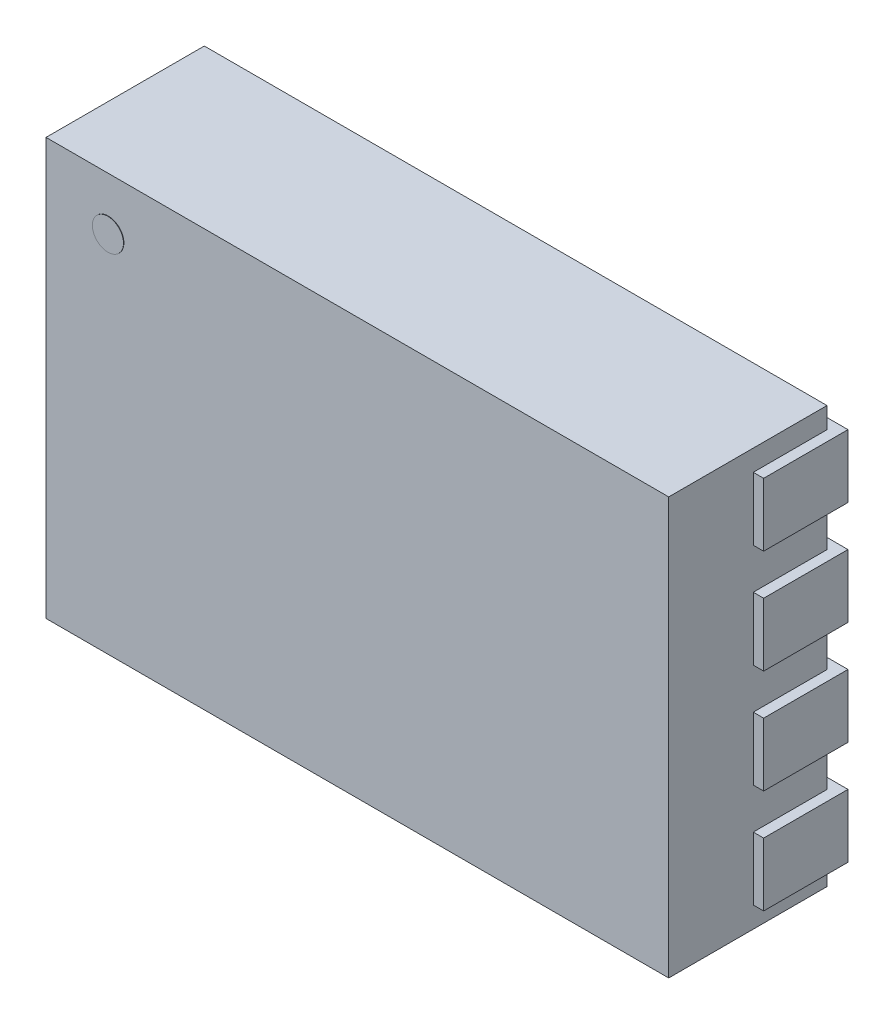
ISO-10303-21;
HEADER;
FILE_DESCRIPTION(('STEP AP214'),'2;1');
FILE_NAME('part.step','',(''),(''),'','','');
FILE_SCHEMA(('AUTOMOTIVE_DESIGN { 1 0 10303 214 1 1 1 1 }'));
ENDSEC;
DATA;
#1=APPLICATION_CONTEXT('core data for automotive mechanical design processes');
#2=APPLICATION_PROTOCOL_DEFINITION('international standard','automotive_design',2000,#1);
#3=PRODUCT_CONTEXT('',#1,'mechanical');
#4=PRODUCT('Part','Part','',(#3));
#5=PRODUCT_RELATED_PRODUCT_CATEGORY('part','',(#4));
#6=PRODUCT_DEFINITION_FORMATION('','',#4);
#7=PRODUCT_DEFINITION_CONTEXT('part definition',#1,'design');
#8=PRODUCT_DEFINITION('design','',#6,#7);
#9=PRODUCT_DEFINITION_SHAPE('','',#8);
#10=(LENGTH_UNIT() NAMED_UNIT(*) SI_UNIT(.MILLI.,.METRE.));
#11=(NAMED_UNIT(*) PLANE_ANGLE_UNIT() SI_UNIT($,.RADIAN.));
#12=(NAMED_UNIT(*) SI_UNIT($,.STERADIAN.) SOLID_ANGLE_UNIT());
#13=UNCERTAINTY_MEASURE_WITH_UNIT(LENGTH_MEASURE(1.E-05),#10,'distance_accuracy_value','');
#14=(GEOMETRIC_REPRESENTATION_CONTEXT(3) GLOBAL_UNCERTAINTY_ASSIGNED_CONTEXT((#13)) GLOBAL_UNIT_ASSIGNED_CONTEXT((#10,
#11,#12)) REPRESENTATION_CONTEXT('',''));
#15=CARTESIAN_POINT('',(0.,0.,0.));
#16=DIRECTION('',(0.,0.,1.));
#17=DIRECTION('',(1.,0.,0.));
#18=AXIS2_PLACEMENT_3D('',#15,#16,#17);
#19=CARTESIAN_POINT('',(-1.199,0.75,0.815));
#20=DIRECTION('',(0.,0.,1.));
#21=DIRECTION('',(1.,0.,0.));
#22=AXIS2_PLACEMENT_3D('',#19,#20,#21);
#23=PLANE('',#22);
#24=CARTESIAN_POINT('',(-1.199,0.75,0.815));
#25=DIRECTION('',(0.,0.,1.));
#26=DIRECTION('',(1.,0.,0.));
#27=AXIS2_PLACEMENT_3D('',#24,#25,#26);
#28=CIRCLE('',#27,0.07493);
#29=CARTESIAN_POINT('',(-1.274,0.75,0.815));
#30=VERTEX_POINT('',#29);
#31=EDGE_CURVE('P0_E45',#30,#30,#28,.T.);
#32=ORIENTED_EDGE('',*,*,#31,.T.);
#33=EDGE_LOOP('',(#32));
#34=FACE_BOUND('',#33,.T.);
#35=ADVANCED_FACE('P0_F17',(#34),#23,.T.);
#36=CARTESIAN_POINT('',(-1.199,0.75,0.813));
#37=DIRECTION('',(0.,0.,1.));
#38=DIRECTION('',(1.,0.,0.));
#39=AXIS2_PLACEMENT_3D('',#36,#37,#38);
#40=PLANE('',#39);
#41=CARTESIAN_POINT('',(-1.199,0.75,0.813));
#42=DIRECTION('',(0.,0.,-1.));
#43=DIRECTION('',(1.,0.,0.));
#44=AXIS2_PLACEMENT_3D('',#41,#42,#43);
#45=CIRCLE('',#44,0.07493);
#46=CARTESIAN_POINT('',(-1.274,0.75,0.813));
#47=VERTEX_POINT('',#46);
#48=EDGE_CURVE('P0_E11',#47,#47,#45,.T.);
#49=ORIENTED_EDGE('',*,*,#48,.T.);
#50=EDGE_LOOP('',(#49));
#51=FACE_BOUND('',#50,.T.);
#52=ADVANCED_FACE('P0_F19',(#51),#40,.F.);
#53=CARTESIAN_POINT('',(-1.199,0.75,0.813));
#54=DIRECTION('',(0.,0.,1.));
#55=DIRECTION('',(1.,0.,0.));
#56=AXIS2_PLACEMENT_3D('',#53,#54,#55);
#57=CYLINDRICAL_SURFACE('',#56,0.07493);
#58=ORIENTED_EDGE('',*,*,#31,.F.);
#59=CARTESIAN_POINT('',(-1.27393,0.75,0.813));
#60=CARTESIAN_POINT('',(-1.27393,0.75,0.815));
#61=(BOUNDED_CURVE() B_SPLINE_CURVE(1,(#59,#60),.UNSPECIFIED.,.F.,
.F.) B_SPLINE_CURVE_WITH_KNOTS((2,2),(0.,0.002),
.UNSPECIFIED.) CURVE() GEOMETRIC_REPRESENTATION_ITEM() RATIONAL_B_SPLINE_CURVE((1.,1.)) REPRESENTATION_ITEM(''));
#62=EDGE_CURVE('P0_E27',#47,#30,#61,.T.);
#63=ORIENTED_EDGE('',*,*,#62,.F.);
#64=ORIENTED_EDGE('',*,*,#48,.F.);
#65=ORIENTED_EDGE('',*,*,#62,.T.);
#66=EDGE_LOOP('',(#58,#63,#64,#65));
#67=FACE_BOUND('',#66,.T.);
#68=ADVANCED_FACE('P0_F44',(#67),#57,.T.);
#69=CLOSED_SHELL('',(#35,#52,#68));
#70=MANIFOLD_SOLID_BREP('P0_B1',#69);
#71=CARTESIAN_POINT('',(-1.549,0.402,0.));
#72=DIRECTION('',(0.,0.,-1.));
#73=DIRECTION('',(0.,-1.,0.));
#74=AXIS2_PLACEMENT_3D('',#71,#72,#73);
#75=PLANE('',#74);
#76=DIRECTION('',(1.,0.,0.));
#77=VECTOR('',#76,1.);
#78=CARTESIAN_POINT('',(-1.549,0.402,0.));
#79=LINE('',#78,#77);
#80=CARTESIAN_POINT('',(-1.549,0.402,0.));
#81=VERTEX_POINT('',#80);
#82=CARTESIAN_POINT('',(-1.143,0.402,0.));
#83=VERTEX_POINT('',#82);
#84=EDGE_CURVE('P1_E114',#81,#83,#79,.T.);
#85=ORIENTED_EDGE('',*,*,#84,.T.);
#86=DIRECTION('',(0.,-1.,0.));
#87=VECTOR('',#86,1.);
#88=CARTESIAN_POINT('',(-1.143,0.402,0.));
#89=LINE('',#88,#87);
#90=CARTESIAN_POINT('',(-1.143,0.098,0.));
#91=VERTEX_POINT('',#90);
#92=EDGE_CURVE('P1_E11',#83,#91,#89,.T.);
#93=ORIENTED_EDGE('',*,*,#92,.T.);
#94=DIRECTION('',(-1.,0.,0.));
#95=VECTOR('',#94,1.);
#96=CARTESIAN_POINT('',(-1.143,0.098,0.));
#97=LINE('',#96,#95);
#98=CARTESIAN_POINT('',(-1.549,0.098,0.));
#99=VERTEX_POINT('',#98);
#100=EDGE_CURVE('P1_E136',#91,#99,#97,.T.);
#101=ORIENTED_EDGE('',*,*,#100,.T.);
#102=DIRECTION('',(0.,1.,0.));
#103=VECTOR('',#102,1.);
#104=CARTESIAN_POINT('',(-1.549,0.098,0.));
#105=LINE('',#104,#103);
#106=EDGE_CURVE('P1_E26',#99,#81,#105,.T.);
#107=ORIENTED_EDGE('',*,*,#106,.T.);
#108=EDGE_LOOP('',(#85,#93,#101,#107));
#109=FACE_BOUND('',#108,.T.);
#110=ADVANCED_FACE('P1_F17',(#109),#75,.T.);
#111=CARTESIAN_POINT('',(-1.499,0.098,0.051));
#112=DIRECTION('',(1.,0.,0.));
#113=DIRECTION('',(0.,1.,0.));
#114=AXIS2_PLACEMENT_3D('',#111,#112,#113);
#115=PLANE('',#114);
#116=DIRECTION('',(0.,1.,0.));
#117=VECTOR('',#116,1.);
#118=CARTESIAN_POINT('',(-1.499,0.098,0.051));
#119=LINE('',#118,#117);
#120=CARTESIAN_POINT('',(-1.499,0.098,0.051));
#121=VERTEX_POINT('',#120);
#122=CARTESIAN_POINT('',(-1.499,0.402,0.051));
#123=VERTEX_POINT('',#122);
#124=EDGE_CURVE('P1_E98',#121,#123,#119,.T.);
#125=ORIENTED_EDGE('',*,*,#124,.T.);
#126=DIRECTION('',(0.,0.,1.));
#127=VECTOR('',#126,1.);
#128=CARTESIAN_POINT('',(-1.499,0.402,0.051));
#129=LINE('',#128,#127);
#130=CARTESIAN_POINT('',(-1.499,0.402,0.406));
#131=VERTEX_POINT('',#130);
#132=EDGE_CURVE('P1_E95',#123,#131,#129,.T.);
#133=ORIENTED_EDGE('',*,*,#132,.T.);
#134=DIRECTION('',(0.,-1.,0.));
#135=VECTOR('',#134,1.);
#136=CARTESIAN_POINT('',(-1.499,0.402,0.406));
#137=LINE('',#136,#135);
#138=CARTESIAN_POINT('',(-1.499,0.098,0.406));
#139=VERTEX_POINT('',#138);
#140=EDGE_CURVE('P1_E79',#131,#139,#137,.T.);
#141=ORIENTED_EDGE('',*,*,#140,.T.);
#142=DIRECTION('',(0.,0.,-1.));
#143=VECTOR('',#142,1.);
#144=CARTESIAN_POINT('',(-1.499,0.098,0.406));
#145=LINE('',#144,#143);
#146=EDGE_CURVE('P1_E120',#139,#121,#145,.T.);
#147=ORIENTED_EDGE('',*,*,#146,.T.);
#148=EDGE_LOOP('',(#125,#133,#141,#147));
#149=FACE_BOUND('',#148,.T.);
#150=ADVANCED_FACE('P1_F96',(#149),#115,.T.);
#151=CARTESIAN_POINT('',(-1.143,0.098,0.));
#152=DIRECTION('',(1.,0.,0.));
#153=DIRECTION('',(0.,1.,0.));
#154=AXIS2_PLACEMENT_3D('',#151,#152,#153);
#155=PLANE('',#154);
#156=ORIENTED_EDGE('',*,*,#92,.F.);
#157=DIRECTION('',(0.,0.,1.));
#158=VECTOR('',#157,1.);
#159=CARTESIAN_POINT('',(-1.143,0.402,0.));
#160=LINE('',#159,#158);
#161=CARTESIAN_POINT('',(-1.143,0.402,0.051));
#162=VERTEX_POINT('',#161);
#163=EDGE_CURVE('P1_E92',#83,#162,#160,.T.);
#164=ORIENTED_EDGE('',*,*,#163,.T.);
#165=DIRECTION('',(0.,-1.,0.));
#166=VECTOR('',#165,1.);
#167=CARTESIAN_POINT('',(-1.143,0.402,0.051));
#168=LINE('',#167,#166);
#169=CARTESIAN_POINT('',(-1.143,0.098,0.051));
#170=VERTEX_POINT('',#169);
#171=EDGE_CURVE('P1_E38',#162,#170,#168,.T.);
#172=ORIENTED_EDGE('',*,*,#171,.T.);
#173=DIRECTION('',(0.,0.,-1.));
#174=VECTOR('',#173,1.);
#175=CARTESIAN_POINT('',(-1.143,0.098,0.051));
#176=LINE('',#175,#174);
#177=EDGE_CURVE('P1_E146',#170,#91,#176,.T.);
#178=ORIENTED_EDGE('',*,*,#177,.T.);
#179=EDGE_LOOP('',(#156,#164,#172,#178));
#180=FACE_BOUND('',#179,.T.);
#181=ADVANCED_FACE('P1_F143',(#180),#155,.T.);
#182=CARTESIAN_POINT('',(-1.549,0.402,0.));
#183=DIRECTION('',(-1.,0.,0.));
#184=DIRECTION('',(0.,0.,1.));
#185=AXIS2_PLACEMENT_3D('',#182,#183,#184);
#186=PLANE('',#185);
#187=ORIENTED_EDGE('',*,*,#106,.F.);
#188=DIRECTION('',(0.,0.,1.));
#189=VECTOR('',#188,1.);
#190=CARTESIAN_POINT('',(-1.549,0.098,0.));
#191=LINE('',#190,#189);
#192=CARTESIAN_POINT('',(-1.549,0.098,0.406));
#193=VERTEX_POINT('',#192);
#194=EDGE_CURVE('P1_E125',#99,#193,#191,.T.);
#195=ORIENTED_EDGE('',*,*,#194,.T.);
#196=DIRECTION('',(0.,1.,0.));
#197=VECTOR('',#196,1.);
#198=CARTESIAN_POINT('',(-1.549,0.098,0.406));
#199=LINE('',#198,#197);
#200=CARTESIAN_POINT('',(-1.549,0.402,0.406));
#201=VERTEX_POINT('',#200);
#202=EDGE_CURVE('P1_E91',#193,#201,#199,.T.);
#203=ORIENTED_EDGE('',*,*,#202,.T.);
#204=DIRECTION('',(0.,0.,-1.));
#205=VECTOR('',#204,1.);
#206=CARTESIAN_POINT('',(-1.549,0.402,0.406));
#207=LINE('',#206,#205);
#208=EDGE_CURVE('P1_E107',#201,#81,#207,.T.);
#209=ORIENTED_EDGE('',*,*,#208,.T.);
#210=EDGE_LOOP('',(#187,#195,#203,#209));
#211=FACE_BOUND('',#210,.T.);
#212=ADVANCED_FACE('P1_F140',(#211),#186,.T.);
#213=CARTESIAN_POINT('',(-1.499,0.098,0.051));
#214=DIRECTION('',(0.,0.,1.));
#215=DIRECTION('',(1.,0.,0.));
#216=AXIS2_PLACEMENT_3D('',#213,#214,#215);
#217=PLANE('',#216);
#218=DIRECTION('',(1.,0.,0.));
#219=VECTOR('',#218,1.);
#220=CARTESIAN_POINT('',(-1.499,0.098,0.051));
#221=LINE('',#220,#219);
#222=EDGE_CURVE('P1_E118',#121,#170,#221,.T.);
#223=ORIENTED_EDGE('',*,*,#222,.T.);
#224=ORIENTED_EDGE('',*,*,#171,.F.);
#225=DIRECTION('',(-1.,0.,0.));
#226=VECTOR('',#225,1.);
#227=CARTESIAN_POINT('',(-1.143,0.402,0.051));
#228=LINE('',#227,#226);
#229=EDGE_CURVE('P1_E102',#162,#123,#228,.T.);
#230=ORIENTED_EDGE('',*,*,#229,.T.);
#231=ORIENTED_EDGE('',*,*,#124,.F.);
#232=EDGE_LOOP('',(#223,#224,#230,#231));
#233=FACE_BOUND('',#232,.T.);
#234=ADVANCED_FACE('P1_F173',(#233),#217,.T.);
#235=CARTESIAN_POINT('',(-1.549,0.098,0.406));
#236=DIRECTION('',(0.,0.,1.));
#237=DIRECTION('',(1.,0.,0.));
#238=AXIS2_PLACEMENT_3D('',#235,#236,#237);
#239=PLANE('',#238);
#240=DIRECTION('',(1.,0.,0.));
#241=VECTOR('',#240,1.);
#242=CARTESIAN_POINT('',(-1.549,0.098,0.406));
#243=LINE('',#242,#241);
#244=EDGE_CURVE('P1_E86',#193,#139,#243,.T.);
#245=ORIENTED_EDGE('',*,*,#244,.T.);
#246=ORIENTED_EDGE('',*,*,#140,.F.);
#247=DIRECTION('',(-1.,0.,0.));
#248=VECTOR('',#247,1.);
#249=CARTESIAN_POINT('',(-1.499,0.402,0.406));
#250=LINE('',#249,#248);
#251=EDGE_CURVE('P1_E83',#131,#201,#250,.T.);
#252=ORIENTED_EDGE('',*,*,#251,.T.);
#253=ORIENTED_EDGE('',*,*,#202,.F.);
#254=EDGE_LOOP('',(#245,#246,#252,#253));
#255=FACE_BOUND('',#254,.T.);
#256=ADVANCED_FACE('P1_F81',(#255),#239,.T.);
#257=CARTESIAN_POINT('',(-1.143,0.402,0.));
#258=DIRECTION('',(0.,1.,0.));
#259=DIRECTION('',(1.,0.,0.));
#260=AXIS2_PLACEMENT_3D('',#257,#258,#259);
#261=PLANE('',#260);
#262=ORIENTED_EDGE('',*,*,#84,.F.);
#263=ORIENTED_EDGE('',*,*,#208,.F.);
#264=ORIENTED_EDGE('',*,*,#251,.F.);
#265=ORIENTED_EDGE('',*,*,#132,.F.);
#266=ORIENTED_EDGE('',*,*,#229,.F.);
#267=ORIENTED_EDGE('',*,*,#163,.F.);
#268=EDGE_LOOP('',(#262,#263,#264,#265,#266,#267));
#269=FACE_BOUND('',#268,.T.);
#270=ADVANCED_FACE('P1_F105',(#269),#261,.T.);
#271=CARTESIAN_POINT('',(-1.549,0.098,0.));
#272=DIRECTION('',(0.,-1.,0.));
#273=DIRECTION('',(0.,0.,-1.));
#274=AXIS2_PLACEMENT_3D('',#271,#272,#273);
#275=PLANE('',#274);
#276=ORIENTED_EDGE('',*,*,#100,.F.);
#277=ORIENTED_EDGE('',*,*,#177,.F.);
#278=ORIENTED_EDGE('',*,*,#222,.F.);
#279=ORIENTED_EDGE('',*,*,#146,.F.);
#280=ORIENTED_EDGE('',*,*,#244,.F.);
#281=ORIENTED_EDGE('',*,*,#194,.F.);
#282=EDGE_LOOP('',(#276,#277,#278,#279,#280,#281));
#283=FACE_BOUND('',#282,.T.);
#284=ADVANCED_FACE('P1_F213',(#283),#275,.T.);
#285=CLOSED_SHELL('',(#110,#150,#181,#212,#234,#256,#270,#284));
#286=MANIFOLD_SOLID_BREP('P1_B1',#285);
#287=CARTESIAN_POINT('',(-1.549,0.902,0.));
#288=DIRECTION('',(0.,0.,-1.));
#289=DIRECTION('',(0.,-1.,0.));
#290=AXIS2_PLACEMENT_3D('',#287,#288,#289);
#291=PLANE('',#290);
#292=DIRECTION('',(1.,0.,0.));
#293=VECTOR('',#292,1.);
#294=CARTESIAN_POINT('',(-1.549,0.902,0.));
#295=LINE('',#294,#293);
#296=CARTESIAN_POINT('',(-1.549,0.902,0.));
#297=VERTEX_POINT('',#296);
#298=CARTESIAN_POINT('',(-1.143,0.902,0.));
#299=VERTEX_POINT('',#298);
#300=EDGE_CURVE('P2_E107',#297,#299,#295,.T.);
#301=ORIENTED_EDGE('',*,*,#300,.T.);
#302=DIRECTION('',(0.,-1.,0.));
#303=VECTOR('',#302,1.);
#304=CARTESIAN_POINT('',(-1.143,0.902,0.));
#305=LINE('',#304,#303);
#306=CARTESIAN_POINT('',(-1.143,0.598,0.));
#307=VERTEX_POINT('',#306);
#308=EDGE_CURVE('P2_E11',#299,#307,#305,.T.);
#309=ORIENTED_EDGE('',*,*,#308,.T.);
#310=DIRECTION('',(-1.,0.,0.));
#311=VECTOR('',#310,1.);
#312=CARTESIAN_POINT('',(-1.143,0.598,0.));
#313=LINE('',#312,#311);
#314=CARTESIAN_POINT('',(-1.549,0.598,0.));
#315=VERTEX_POINT('',#314);
#316=EDGE_CURVE('P2_E134',#307,#315,#313,.T.);
#317=ORIENTED_EDGE('',*,*,#316,.T.);
#318=DIRECTION('',(0.,1.,0.));
#319=VECTOR('',#318,1.);
#320=CARTESIAN_POINT('',(-1.549,0.598,0.));
#321=LINE('',#320,#319);
#322=EDGE_CURVE('P2_E26',#315,#297,#321,.T.);
#323=ORIENTED_EDGE('',*,*,#322,.T.);
#324=EDGE_LOOP('',(#301,#309,#317,#323));
#325=FACE_BOUND('',#324,.T.);
#326=ADVANCED_FACE('P2_F17',(#325),#291,.T.);
#327=CARTESIAN_POINT('',(-1.499,0.598,0.051));
#328=DIRECTION('',(1.,0.,0.));
#329=DIRECTION('',(0.,1.,0.));
#330=AXIS2_PLACEMENT_3D('',#327,#328,#329);
#331=PLANE('',#330);
#332=DIRECTION('',(0.,1.,0.));
#333=VECTOR('',#332,1.);
#334=CARTESIAN_POINT('',(-1.499,0.598,0.051));
#335=LINE('',#334,#333);
#336=CARTESIAN_POINT('',(-1.499,0.598,0.051));
#337=VERTEX_POINT('',#336);
#338=CARTESIAN_POINT('',(-1.499,0.902,0.051));
#339=VERTEX_POINT('',#338);
#340=EDGE_CURVE('P2_E127',#337,#339,#335,.T.);
#341=ORIENTED_EDGE('',*,*,#340,.T.);
#342=DIRECTION('',(0.,0.,1.));
#343=VECTOR('',#342,1.);
#344=CARTESIAN_POINT('',(-1.499,0.902,0.051));
#345=LINE('',#344,#343);
#346=CARTESIAN_POINT('',(-1.499,0.902,0.406));
#347=VERTEX_POINT('',#346);
#348=EDGE_CURVE('P2_E102',#339,#347,#345,.T.);
#349=ORIENTED_EDGE('',*,*,#348,.T.);
#350=DIRECTION('',(0.,-1.,0.));
#351=VECTOR('',#350,1.);
#352=CARTESIAN_POINT('',(-1.499,0.902,0.406));
#353=LINE('',#352,#351);
#354=CARTESIAN_POINT('',(-1.499,0.598,0.406));
#355=VERTEX_POINT('',#354);
#356=EDGE_CURVE('P2_E93',#347,#355,#353,.T.);
#357=ORIENTED_EDGE('',*,*,#356,.T.);
#358=DIRECTION('',(0.,0.,-1.));
#359=VECTOR('',#358,1.);
#360=CARTESIAN_POINT('',(-1.499,0.598,0.406));
#361=LINE('',#360,#359);
#362=EDGE_CURVE('P2_E146',#355,#337,#361,.T.);
#363=ORIENTED_EDGE('',*,*,#362,.T.);
#364=EDGE_LOOP('',(#341,#349,#357,#363));
#365=FACE_BOUND('',#364,.T.);
#366=ADVANCED_FACE('P2_F174',(#365),#331,.T.);
#367=CARTESIAN_POINT('',(-1.143,0.598,0.));
#368=DIRECTION('',(1.,0.,0.));
#369=DIRECTION('',(0.,1.,0.));
#370=AXIS2_PLACEMENT_3D('',#367,#368,#369);
#371=PLANE('',#370);
#372=ORIENTED_EDGE('',*,*,#308,.F.);
#373=DIRECTION('',(0.,0.,1.));
#374=VECTOR('',#373,1.);
#375=CARTESIAN_POINT('',(-1.143,0.902,0.));
#376=LINE('',#375,#374);
#377=CARTESIAN_POINT('',(-1.143,0.902,0.051));
#378=VERTEX_POINT('',#377);
#379=EDGE_CURVE('P2_E118',#299,#378,#376,.T.);
#380=ORIENTED_EDGE('',*,*,#379,.T.);
#381=DIRECTION('',(0.,-1.,0.));
#382=VECTOR('',#381,1.);
#383=CARTESIAN_POINT('',(-1.143,0.902,0.051));
#384=LINE('',#383,#382);
#385=CARTESIAN_POINT('',(-1.143,0.598,0.051));
#386=VERTEX_POINT('',#385);
#387=EDGE_CURVE('P2_E38',#378,#386,#384,.T.);
#388=ORIENTED_EDGE('',*,*,#387,.T.);
#389=DIRECTION('',(0.,0.,-1.));
#390=VECTOR('',#389,1.);
#391=CARTESIAN_POINT('',(-1.143,0.598,0.051));
#392=LINE('',#391,#390);
#393=EDGE_CURVE('P2_E155',#386,#307,#392,.T.);
#394=ORIENTED_EDGE('',*,*,#393,.T.);
#395=EDGE_LOOP('',(#372,#380,#388,#394));
#396=FACE_BOUND('',#395,.T.);
#397=ADVANCED_FACE('P2_F166',(#396),#371,.T.);
#398=CARTESIAN_POINT('',(-1.549,0.902,0.));
#399=DIRECTION('',(-1.,0.,0.));
#400=DIRECTION('',(0.,0.,1.));
#401=AXIS2_PLACEMENT_3D('',#398,#399,#400);
#402=PLANE('',#401);
#403=ORIENTED_EDGE('',*,*,#322,.F.);
#404=DIRECTION('',(0.,0.,1.));
#405=VECTOR('',#404,1.);
#406=CARTESIAN_POINT('',(-1.549,0.598,0.));
#407=LINE('',#406,#405);
#408=CARTESIAN_POINT('',(-1.549,0.598,0.406));
#409=VERTEX_POINT('',#408);
#410=EDGE_CURVE('P2_E88',#315,#409,#407,.T.);
#411=ORIENTED_EDGE('',*,*,#410,.T.);
#412=DIRECTION('',(0.,1.,0.));
#413=VECTOR('',#412,1.);
#414=CARTESIAN_POINT('',(-1.549,0.598,0.406));
#415=LINE('',#414,#413);
#416=CARTESIAN_POINT('',(-1.549,0.902,0.406));
#417=VERTEX_POINT('',#416);
#418=EDGE_CURVE('P2_E81',#409,#417,#415,.T.);
#419=ORIENTED_EDGE('',*,*,#418,.T.);
#420=DIRECTION('',(0.,0.,-1.));
#421=VECTOR('',#420,1.);
#422=CARTESIAN_POINT('',(-1.549,0.902,0.406));
#423=LINE('',#422,#421);
#424=EDGE_CURVE('P2_E85',#417,#297,#423,.T.);
#425=ORIENTED_EDGE('',*,*,#424,.T.);
#426=EDGE_LOOP('',(#403,#411,#419,#425));
#427=FACE_BOUND('',#426,.T.);
#428=ADVANCED_FACE('P2_F83',(#427),#402,.T.);
#429=CARTESIAN_POINT('',(-1.499,0.598,0.051));
#430=DIRECTION('',(0.,0.,1.));
#431=DIRECTION('',(1.,0.,0.));
#432=AXIS2_PLACEMENT_3D('',#429,#430,#431);
#433=PLANE('',#432);
#434=DIRECTION('',(1.,0.,0.));
#435=VECTOR('',#434,1.);
#436=CARTESIAN_POINT('',(-1.499,0.598,0.051));
#437=LINE('',#436,#435);
#438=EDGE_CURVE('P2_E149',#337,#386,#437,.T.);
#439=ORIENTED_EDGE('',*,*,#438,.T.);
#440=ORIENTED_EDGE('',*,*,#387,.F.);
#441=DIRECTION('',(-1.,0.,0.));
#442=VECTOR('',#441,1.);
#443=CARTESIAN_POINT('',(-1.143,0.902,0.051));
#444=LINE('',#443,#442);
#445=EDGE_CURVE('P2_E116',#378,#339,#444,.T.);
#446=ORIENTED_EDGE('',*,*,#445,.T.);
#447=ORIENTED_EDGE('',*,*,#340,.F.);
#448=EDGE_LOOP('',(#439,#440,#446,#447));
#449=FACE_BOUND('',#448,.T.);
#450=ADVANCED_FACE('P2_F202',(#449),#433,.T.);
#451=CARTESIAN_POINT('',(-1.549,0.598,0.406));
#452=DIRECTION('',(0.,0.,1.));
#453=DIRECTION('',(1.,0.,0.));
#454=AXIS2_PLACEMENT_3D('',#451,#452,#453);
#455=PLANE('',#454);
#456=DIRECTION('',(1.,0.,0.));
#457=VECTOR('',#456,1.);
#458=CARTESIAN_POINT('',(-1.549,0.598,0.406));
#459=LINE('',#458,#457);
#460=EDGE_CURVE('P2_E139',#409,#355,#459,.T.);
#461=ORIENTED_EDGE('',*,*,#460,.T.);
#462=ORIENTED_EDGE('',*,*,#356,.F.);
#463=DIRECTION('',(-1.,0.,0.));
#464=VECTOR('',#463,1.);
#465=CARTESIAN_POINT('',(-1.499,0.902,0.406));
#466=LINE('',#465,#464);
#467=EDGE_CURVE('P2_E96',#347,#417,#466,.T.);
#468=ORIENTED_EDGE('',*,*,#467,.T.);
#469=ORIENTED_EDGE('',*,*,#418,.F.);
#470=EDGE_LOOP('',(#461,#462,#468,#469));
#471=FACE_BOUND('',#470,.T.);
#472=ADVANCED_FACE('P2_F97',(#471),#455,.T.);
#473=CARTESIAN_POINT('',(-1.143,0.902,0.));
#474=DIRECTION('',(0.,1.,0.));
#475=DIRECTION('',(1.,0.,0.));
#476=AXIS2_PLACEMENT_3D('',#473,#474,#475);
#477=PLANE('',#476);
#478=ORIENTED_EDGE('',*,*,#300,.F.);
#479=ORIENTED_EDGE('',*,*,#424,.F.);
#480=ORIENTED_EDGE('',*,*,#467,.F.);
#481=ORIENTED_EDGE('',*,*,#348,.F.);
#482=ORIENTED_EDGE('',*,*,#445,.F.);
#483=ORIENTED_EDGE('',*,*,#379,.F.);
#484=EDGE_LOOP('',(#478,#479,#480,#481,#482,#483));
#485=FACE_BOUND('',#484,.T.);
#486=ADVANCED_FACE('P2_F104',(#485),#477,.T.);
#487=CARTESIAN_POINT('',(-1.549,0.598,0.));
#488=DIRECTION('',(0.,-1.,0.));
#489=DIRECTION('',(0.,0.,-1.));
#490=AXIS2_PLACEMENT_3D('',#487,#488,#489);
#491=PLANE('',#490);
#492=ORIENTED_EDGE('',*,*,#316,.F.);
#493=ORIENTED_EDGE('',*,*,#393,.F.);
#494=ORIENTED_EDGE('',*,*,#438,.F.);
#495=ORIENTED_EDGE('',*,*,#362,.F.);
#496=ORIENTED_EDGE('',*,*,#460,.F.);
#497=ORIENTED_EDGE('',*,*,#410,.F.);
#498=EDGE_LOOP('',(#492,#493,#494,#495,#496,#497));
#499=FACE_BOUND('',#498,.T.);
#500=ADVANCED_FACE('P2_F136',(#499),#491,.T.);
#501=CLOSED_SHELL('',(#326,#366,#397,#428,#450,#472,#486,#500));
#502=MANIFOLD_SOLID_BREP('P2_B1',#501);
#503=CARTESIAN_POINT('',(-1.499,-1.003,0.813));
#504=DIRECTION('',(0.,0.,1.));
#505=DIRECTION('',(1.,0.,0.));
#506=AXIS2_PLACEMENT_3D('',#503,#504,#505);
#507=PLANE('',#506);
#508=DIRECTION('',(1.,0.,0.));
#509=VECTOR('',#508,1.);
#510=CARTESIAN_POINT('',(-1.499,-1.003,0.813));
#511=LINE('',#510,#509);
#512=CARTESIAN_POINT('',(-1.499,-1.003,0.813));
#513=VERTEX_POINT('',#512);
#514=CARTESIAN_POINT('',(1.499,-1.003,0.813));
#515=VERTEX_POINT('',#514);
#516=EDGE_CURVE('P3_E98',#513,#515,#511,.T.);
#517=ORIENTED_EDGE('',*,*,#516,.T.);
#518=DIRECTION('',(0.,1.,0.));
#519=VECTOR('',#518,1.);
#520=CARTESIAN_POINT('',(1.499,-1.003,0.813));
#521=LINE('',#520,#519);
#522=CARTESIAN_POINT('',(1.499,1.003,0.813));
#523=VERTEX_POINT('',#522);
#524=EDGE_CURVE('P3_E78',#515,#523,#521,.T.);
#525=ORIENTED_EDGE('',*,*,#524,.T.);
#526=DIRECTION('',(-1.,0.,0.));
#527=VECTOR('',#526,1.);
#528=CARTESIAN_POINT('',(1.499,1.003,0.813));
#529=LINE('',#528,#527);
#530=CARTESIAN_POINT('',(-1.499,1.003,0.813));
#531=VERTEX_POINT('',#530);
#532=EDGE_CURVE('P3_E83',#523,#531,#529,.T.);
#533=ORIENTED_EDGE('',*,*,#532,.T.);
#534=DIRECTION('',(0.,-1.,0.));
#535=VECTOR('',#534,1.);
#536=CARTESIAN_POINT('',(-1.499,1.003,0.813));
#537=LINE('',#536,#535);
#538=EDGE_CURVE('P3_E11',#531,#513,#537,.T.);
#539=ORIENTED_EDGE('',*,*,#538,.T.);
#540=EDGE_LOOP('',(#517,#525,#533,#539));
#541=FACE_BOUND('',#540,.T.);
#542=ADVANCED_FACE('P3_F17',(#541),#507,.T.);
#543=CARTESIAN_POINT('',(-1.499,1.003,0.051));
#544=DIRECTION('',(0.,0.,-1.));
#545=DIRECTION('',(0.,-1.,0.));
#546=AXIS2_PLACEMENT_3D('',#543,#544,#545);
#547=PLANE('',#546);
#548=DIRECTION('',(1.,0.,0.));
#549=VECTOR('',#548,1.);
#550=CARTESIAN_POINT('',(-1.499,1.003,0.051));
#551=LINE('',#550,#549);
#552=CARTESIAN_POINT('',(-1.499,1.003,0.051));
#553=VERTEX_POINT('',#552);
#554=CARTESIAN_POINT('',(1.499,1.003,0.051));
#555=VERTEX_POINT('',#554);
#556=EDGE_CURVE('P3_E68',#553,#555,#551,.T.);
#557=ORIENTED_EDGE('',*,*,#556,.T.);
#558=DIRECTION('',(0.,-1.,0.));
#559=VECTOR('',#558,1.);
#560=CARTESIAN_POINT('',(1.499,1.003,0.051));
#561=LINE('',#560,#559);
#562=CARTESIAN_POINT('',(1.499,-1.003,0.051));
#563=VERTEX_POINT('',#562);
#564=EDGE_CURVE('P3_E72',#555,#563,#561,.T.);
#565=ORIENTED_EDGE('',*,*,#564,.T.);
#566=DIRECTION('',(-1.,0.,0.));
#567=VECTOR('',#566,1.);
#568=CARTESIAN_POINT('',(1.499,-1.003,0.051));
#569=LINE('',#568,#567);
#570=CARTESIAN_POINT('',(-1.499,-1.003,0.051));
#571=VERTEX_POINT('',#570);
#572=EDGE_CURVE('P3_E111',#563,#571,#569,.T.);
#573=ORIENTED_EDGE('',*,*,#572,.T.);
#574=DIRECTION('',(0.,1.,0.));
#575=VECTOR('',#574,1.);
#576=CARTESIAN_POINT('',(-1.499,-1.003,0.051));
#577=LINE('',#576,#575);
#578=EDGE_CURVE('P3_E26',#571,#553,#577,.T.);
#579=ORIENTED_EDGE('',*,*,#578,.T.);
#580=EDGE_LOOP('',(#557,#565,#573,#579));
#581=FACE_BOUND('',#580,.T.);
#582=ADVANCED_FACE('P3_F70',(#581),#547,.T.);
#583=CARTESIAN_POINT('',(-1.499,1.003,0.051));
#584=DIRECTION('',(-1.,0.,0.));
#585=DIRECTION('',(0.,0.,1.));
#586=AXIS2_PLACEMENT_3D('',#583,#584,#585);
#587=PLANE('',#586);
#588=ORIENTED_EDGE('',*,*,#578,.F.);
#589=DIRECTION('',(0.,0.,1.));
#590=VECTOR('',#589,1.);
#591=CARTESIAN_POINT('',(-1.499,-1.003,0.051));
#592=LINE('',#591,#590);
#593=EDGE_CURVE('P3_E93',#571,#513,#592,.T.);
#594=ORIENTED_EDGE('',*,*,#593,.T.);
#595=ORIENTED_EDGE('',*,*,#538,.F.);
#596=DIRECTION('',(0.,0.,-1.));
#597=VECTOR('',#596,1.);
#598=CARTESIAN_POINT('',(-1.499,1.003,0.813));
#599=LINE('',#598,#597);
#600=EDGE_CURVE('P3_E77',#531,#553,#599,.T.);
#601=ORIENTED_EDGE('',*,*,#600,.T.);
#602=EDGE_LOOP('',(#588,#594,#595,#601));
#603=FACE_BOUND('',#602,.T.);
#604=ADVANCED_FACE('P3_F19',(#603),#587,.T.);
#605=CARTESIAN_POINT('',(1.499,1.003,0.051));
#606=DIRECTION('',(0.,1.,0.));
#607=DIRECTION('',(1.,0.,0.));
#608=AXIS2_PLACEMENT_3D('',#605,#606,#607);
#609=PLANE('',#608);
#610=ORIENTED_EDGE('',*,*,#556,.F.);
#611=ORIENTED_EDGE('',*,*,#600,.F.);
#612=ORIENTED_EDGE('',*,*,#532,.F.);
#613=DIRECTION('',(0.,0.,-1.));
#614=VECTOR('',#613,1.);
#615=CARTESIAN_POINT('',(1.499,1.003,0.813));
#616=LINE('',#615,#614);
#617=EDGE_CURVE('P3_E81',#523,#555,#616,.T.);
#618=ORIENTED_EDGE('',*,*,#617,.T.);
#619=EDGE_LOOP('',(#610,#611,#612,#618));
#620=FACE_BOUND('',#619,.T.);
#621=ADVANCED_FACE('P3_F82',(#620),#609,.T.);
#622=CARTESIAN_POINT('',(1.499,-1.003,0.051));
#623=DIRECTION('',(1.,0.,0.));
#624=DIRECTION('',(0.,1.,0.));
#625=AXIS2_PLACEMENT_3D('',#622,#623,#624);
#626=PLANE('',#625);
#627=ORIENTED_EDGE('',*,*,#564,.F.);
#628=ORIENTED_EDGE('',*,*,#617,.F.);
#629=ORIENTED_EDGE('',*,*,#524,.F.);
#630=DIRECTION('',(0.,0.,-1.));
#631=VECTOR('',#630,1.);
#632=CARTESIAN_POINT('',(1.499,-1.003,0.813));
#633=LINE('',#632,#631);
#634=EDGE_CURVE('P3_E90',#515,#563,#633,.T.);
#635=ORIENTED_EDGE('',*,*,#634,.T.);
#636=EDGE_LOOP('',(#627,#628,#629,#635));
#637=FACE_BOUND('',#636,.T.);
#638=ADVANCED_FACE('P3_F88',(#637),#626,.T.);
#639=CARTESIAN_POINT('',(-1.499,-1.003,0.051));
#640=DIRECTION('',(0.,-1.,0.));
#641=DIRECTION('',(0.,0.,-1.));
#642=AXIS2_PLACEMENT_3D('',#639,#640,#641);
#643=PLANE('',#642);
#644=ORIENTED_EDGE('',*,*,#572,.F.);
#645=ORIENTED_EDGE('',*,*,#634,.F.);
#646=ORIENTED_EDGE('',*,*,#516,.F.);
#647=ORIENTED_EDGE('',*,*,#593,.F.);
#648=EDGE_LOOP('',(#644,#645,#646,#647));
#649=FACE_BOUND('',#648,.T.);
#650=ADVANCED_FACE('P3_F110',(#649),#643,.T.);
#651=CLOSED_SHELL('',(#542,#582,#604,#621,#638,#650));
#652=MANIFOLD_SOLID_BREP('P3_B1',#651);
#653=CARTESIAN_POINT('',(-0.648,-0.698,0.051));
#654=DIRECTION('',(0.,0.,1.));
#655=DIRECTION('',(1.,0.,0.));
#656=AXIS2_PLACEMENT_3D('',#653,#654,#655);
#657=PLANE('',#656);
#658=DIRECTION('',(1.,0.,0.));
#659=VECTOR('',#658,1.);
#660=CARTESIAN_POINT('',(-0.648,-0.698,0.051));
#661=LINE('',#660,#659);
#662=CARTESIAN_POINT('',(-0.648,-0.698,0.051));
#663=VERTEX_POINT('',#662);
#664=CARTESIAN_POINT('',(0.648,-0.698,0.051));
#665=VERTEX_POINT('',#664);
#666=EDGE_CURVE('P4_E85',#663,#665,#661,.T.);
#667=ORIENTED_EDGE('',*,*,#666,.T.);
#668=DIRECTION('',(0.,1.,0.));
#669=VECTOR('',#668,1.);
#670=CARTESIAN_POINT('',(0.648,-0.698,0.051));
#671=LINE('',#670,#669);
#672=CARTESIAN_POINT('',(0.648,0.698,0.051));
#673=VERTEX_POINT('',#672);
#674=EDGE_CURVE('P4_E108',#665,#673,#671,.T.);
#675=ORIENTED_EDGE('',*,*,#674,.T.);
#676=DIRECTION('',(-1.,0.,0.));
#677=VECTOR('',#676,1.);
#678=CARTESIAN_POINT('',(0.648,0.698,0.051));
#679=LINE('',#678,#677);
#680=CARTESIAN_POINT('',(-0.648,0.698,0.051));
#681=VERTEX_POINT('',#680);
#682=EDGE_CURVE('P4_E50',#673,#681,#679,.T.);
#683=ORIENTED_EDGE('',*,*,#682,.T.);
#684=DIRECTION('',(0.,-1.,0.));
#685=VECTOR('',#684,1.);
#686=CARTESIAN_POINT('',(-0.648,0.698,0.051));
#687=LINE('',#686,#685);
#688=EDGE_CURVE('P4_E11',#681,#663,#687,.T.);
#689=ORIENTED_EDGE('',*,*,#688,.T.);
#690=EDGE_LOOP('',(#667,#675,#683,#689));
#691=FACE_BOUND('',#690,.T.);
#692=ADVANCED_FACE('P4_F17',(#691),#657,.T.);
#693=CARTESIAN_POINT('',(-0.648,0.698,0.));
#694=DIRECTION('',(0.,0.,-1.));
#695=DIRECTION('',(0.,-1.,0.));
#696=AXIS2_PLACEMENT_3D('',#693,#694,#695);
#697=PLANE('',#696);
#698=DIRECTION('',(1.,0.,0.));
#699=VECTOR('',#698,1.);
#700=CARTESIAN_POINT('',(-0.648,0.698,0.));
#701=LINE('',#700,#699);
#702=CARTESIAN_POINT('',(-0.648,0.698,0.));
#703=VERTEX_POINT('',#702);
#704=CARTESIAN_POINT('',(0.648,0.698,0.));
#705=VERTEX_POINT('',#704);
#706=EDGE_CURVE('P4_E61',#703,#705,#701,.T.);
#707=ORIENTED_EDGE('',*,*,#706,.T.);
#708=DIRECTION('',(0.,-1.,0.));
#709=VECTOR('',#708,1.);
#710=CARTESIAN_POINT('',(0.648,0.698,0.));
#711=LINE('',#710,#709);
#712=CARTESIAN_POINT('',(0.648,-0.698,0.));
#713=VERTEX_POINT('',#712);
#714=EDGE_CURVE('P4_E87',#705,#713,#711,.T.);
#715=ORIENTED_EDGE('',*,*,#714,.T.);
#716=DIRECTION('',(-1.,0.,0.));
#717=VECTOR('',#716,1.);
#718=CARTESIAN_POINT('',(0.648,-0.698,0.));
#719=LINE('',#718,#717);
#720=CARTESIAN_POINT('',(-0.648,-0.698,0.));
#721=VERTEX_POINT('',#720);
#722=EDGE_CURVE('P4_E83',#713,#721,#719,.T.);
#723=ORIENTED_EDGE('',*,*,#722,.T.);
#724=DIRECTION('',(0.,1.,0.));
#725=VECTOR('',#724,1.);
#726=CARTESIAN_POINT('',(-0.648,-0.698,0.));
#727=LINE('',#726,#725);
#728=EDGE_CURVE('P4_E26',#721,#703,#727,.T.);
#729=ORIENTED_EDGE('',*,*,#728,.T.);
#730=EDGE_LOOP('',(#707,#715,#723,#729));
#731=FACE_BOUND('',#730,.T.);
#732=ADVANCED_FACE('P4_F89',(#731),#697,.T.);
#733=CARTESIAN_POINT('',(-0.648,0.698,0.));
#734=DIRECTION('',(-1.,0.,0.));
#735=DIRECTION('',(0.,0.,1.));
#736=AXIS2_PLACEMENT_3D('',#733,#734,#735);
#737=PLANE('',#736);
#738=ORIENTED_EDGE('',*,*,#728,.F.);
#739=DIRECTION('',(0.,0.,1.));
#740=VECTOR('',#739,1.);
#741=CARTESIAN_POINT('',(-0.648,-0.698,0.));
#742=LINE('',#741,#740);
#743=EDGE_CURVE('P4_E74',#721,#663,#742,.T.);
#744=ORIENTED_EDGE('',*,*,#743,.T.);
#745=ORIENTED_EDGE('',*,*,#688,.F.);
#746=DIRECTION('',(0.,0.,-1.));
#747=VECTOR('',#746,1.);
#748=CARTESIAN_POINT('',(-0.648,0.698,0.051));
#749=LINE('',#748,#747);
#750=EDGE_CURVE('P4_E76',#681,#703,#749,.T.);
#751=ORIENTED_EDGE('',*,*,#750,.T.);
#752=EDGE_LOOP('',(#738,#744,#745,#751));
#753=FACE_BOUND('',#752,.T.);
#754=ADVANCED_FACE('P4_F73',(#753),#737,.T.);
#755=CARTESIAN_POINT('',(0.648,0.698,0.));
#756=DIRECTION('',(0.,1.,0.));
#757=DIRECTION('',(1.,0.,0.));
#758=AXIS2_PLACEMENT_3D('',#755,#756,#757);
#759=PLANE('',#758);
#760=ORIENTED_EDGE('',*,*,#706,.F.);
#761=ORIENTED_EDGE('',*,*,#750,.F.);
#762=ORIENTED_EDGE('',*,*,#682,.F.);
#763=DIRECTION('',(0.,0.,-1.));
#764=VECTOR('',#763,1.);
#765=CARTESIAN_POINT('',(0.648,0.698,0.051));
#766=LINE('',#765,#764);
#767=EDGE_CURVE('P4_E100',#673,#705,#766,.T.);
#768=ORIENTED_EDGE('',*,*,#767,.T.);
#769=EDGE_LOOP('',(#760,#761,#762,#768));
#770=FACE_BOUND('',#769,.T.);
#771=ADVANCED_FACE('P4_F117',(#770),#759,.T.);
#772=CARTESIAN_POINT('',(0.648,-0.698,0.));
#773=DIRECTION('',(1.,0.,0.));
#774=DIRECTION('',(0.,1.,0.));
#775=AXIS2_PLACEMENT_3D('',#772,#773,#774);
#776=PLANE('',#775);
#777=ORIENTED_EDGE('',*,*,#714,.F.);
#778=ORIENTED_EDGE('',*,*,#767,.F.);
#779=ORIENTED_EDGE('',*,*,#674,.F.);
#780=DIRECTION('',(0.,0.,-1.));
#781=VECTOR('',#780,1.);
#782=CARTESIAN_POINT('',(0.648,-0.698,0.051));
#783=LINE('',#782,#781);
#784=EDGE_CURVE('P4_E93',#665,#713,#783,.T.);
#785=ORIENTED_EDGE('',*,*,#784,.T.);
#786=EDGE_LOOP('',(#777,#778,#779,#785));
#787=FACE_BOUND('',#786,.T.);
#788=ADVANCED_FACE('P4_F119',(#787),#776,.T.);
#789=CARTESIAN_POINT('',(-0.648,-0.698,0.));
#790=DIRECTION('',(0.,-1.,0.));
#791=DIRECTION('',(0.,0.,-1.));
#792=AXIS2_PLACEMENT_3D('',#789,#790,#791);
#793=PLANE('',#792);
#794=ORIENTED_EDGE('',*,*,#722,.F.);
#795=ORIENTED_EDGE('',*,*,#784,.F.);
#796=ORIENTED_EDGE('',*,*,#666,.F.);
#797=ORIENTED_EDGE('',*,*,#743,.F.);
#798=EDGE_LOOP('',(#794,#795,#796,#797));
#799=FACE_BOUND('',#798,.T.);
#800=ADVANCED_FACE('P4_F81',(#799),#793,.T.);
#801=CLOSED_SHELL('',(#692,#732,#754,#771,#788,#800));
#802=MANIFOLD_SOLID_BREP('P4_B1',#801);
#803=CARTESIAN_POINT('',(1.549,0.598,0.));
#804=DIRECTION('',(0.,0.,-1.));
#805=DIRECTION('',(0.,-1.,0.));
#806=AXIS2_PLACEMENT_3D('',#803,#804,#805);
#807=PLANE('',#806);
#808=DIRECTION('',(-1.,0.,0.));
#809=VECTOR('',#808,1.);
#810=CARTESIAN_POINT('',(1.549,0.598,0.));
#811=LINE('',#810,#809);
#812=CARTESIAN_POINT('',(1.549,0.598,0.));
#813=VERTEX_POINT('',#812);
#814=CARTESIAN_POINT('',(1.143,0.598,0.));
#815=VERTEX_POINT('',#814);
#816=EDGE_CURVE('P5_E118',#813,#815,#811,.T.);
#817=ORIENTED_EDGE('',*,*,#816,.T.);
#818=DIRECTION('',(0.,1.,0.));
#819=VECTOR('',#818,1.);
#820=CARTESIAN_POINT('',(1.143,0.598,0.));
#821=LINE('',#820,#819);
#822=CARTESIAN_POINT('',(1.143,0.902,0.));
#823=VERTEX_POINT('',#822);
#824=EDGE_CURVE('P5_E11',#815,#823,#821,.T.);
#825=ORIENTED_EDGE('',*,*,#824,.T.);
#826=DIRECTION('',(1.,0.,0.));
#827=VECTOR('',#826,1.);
#828=CARTESIAN_POINT('',(1.143,0.902,0.));
#829=LINE('',#828,#827);
#830=CARTESIAN_POINT('',(1.549,0.902,0.));
#831=VERTEX_POINT('',#830);
#832=EDGE_CURVE('P5_E108',#823,#831,#829,.T.);
#833=ORIENTED_EDGE('',*,*,#832,.T.);
#834=DIRECTION('',(0.,-1.,0.));
#835=VECTOR('',#834,1.);
#836=CARTESIAN_POINT('',(1.549,0.902,0.));
#837=LINE('',#836,#835);
#838=EDGE_CURVE('P5_E25',#831,#813,#837,.T.);
#839=ORIENTED_EDGE('',*,*,#838,.T.);
#840=EDGE_LOOP('',(#817,#825,#833,#839));
#841=FACE_BOUND('',#840,.T.);
#842=ADVANCED_FACE('P5_F17',(#841),#807,.T.);
#843=CARTESIAN_POINT('',(1.499,0.902,0.051));
#844=DIRECTION('',(-1.,0.,0.));
#845=DIRECTION('',(0.,0.,1.));
#846=AXIS2_PLACEMENT_3D('',#843,#844,#845);
#847=PLANE('',#846);
#848=DIRECTION('',(0.,-1.,0.));
#849=VECTOR('',#848,1.);
#850=CARTESIAN_POINT('',(1.499,0.902,0.051));
#851=LINE('',#850,#849);
#852=CARTESIAN_POINT('',(1.499,0.902,0.051));
#853=VERTEX_POINT('',#852);
#854=CARTESIAN_POINT('',(1.499,0.598,0.051));
#855=VERTEX_POINT('',#854);
#856=EDGE_CURVE('P5_E49',#853,#855,#851,.T.);
#857=ORIENTED_EDGE('',*,*,#856,.T.);
#858=DIRECTION('',(0.,0.,1.));
#859=VECTOR('',#858,1.);
#860=CARTESIAN_POINT('',(1.499,0.598,0.051));
#861=LINE('',#860,#859);
#862=CARTESIAN_POINT('',(1.499,0.598,0.406));
#863=VERTEX_POINT('',#862);
#864=EDGE_CURVE('P5_E132',#855,#863,#861,.T.);
#865=ORIENTED_EDGE('',*,*,#864,.T.);
#866=DIRECTION('',(0.,1.,0.));
#867=VECTOR('',#866,1.);
#868=CARTESIAN_POINT('',(1.499,0.598,0.406));
#869=LINE('',#868,#867);
#870=CARTESIAN_POINT('',(1.499,0.902,0.406));
#871=VERTEX_POINT('',#870);
#872=EDGE_CURVE('P5_E144',#863,#871,#869,.T.);
#873=ORIENTED_EDGE('',*,*,#872,.T.);
#874=DIRECTION('',(0.,0.,-1.));
#875=VECTOR('',#874,1.);
#876=CARTESIAN_POINT('',(1.499,0.902,0.406));
#877=LINE('',#876,#875);
#878=EDGE_CURVE('P5_E103',#871,#853,#877,.T.);
#879=ORIENTED_EDGE('',*,*,#878,.T.);
#880=EDGE_LOOP('',(#857,#865,#873,#879));
#881=FACE_BOUND('',#880,.T.);
#882=ADVANCED_FACE('P5_F213',(#881),#847,.T.);
#883=CARTESIAN_POINT('',(1.143,0.902,0.));
#884=DIRECTION('',(-1.,0.,0.));
#885=DIRECTION('',(0.,0.,1.));
#886=AXIS2_PLACEMENT_3D('',#883,#884,#885);
#887=PLANE('',#886);
#888=ORIENTED_EDGE('',*,*,#824,.F.);
#889=DIRECTION('',(0.,0.,1.));
#890=VECTOR('',#889,1.);
#891=CARTESIAN_POINT('',(1.143,0.598,0.));
#892=LINE('',#891,#890);
#893=CARTESIAN_POINT('',(1.143,0.598,0.051));
#894=VERTEX_POINT('',#893);
#895=EDGE_CURVE('P5_E92',#815,#894,#892,.T.);
#896=ORIENTED_EDGE('',*,*,#895,.T.);
#897=DIRECTION('',(0.,1.,0.));
#898=VECTOR('',#897,1.);
#899=CARTESIAN_POINT('',(1.143,0.598,0.051));
#900=LINE('',#899,#898);
#901=CARTESIAN_POINT('',(1.143,0.902,0.051));
#902=VERTEX_POINT('',#901);
#903=EDGE_CURVE('P5_E37',#894,#902,#900,.T.);
#904=ORIENTED_EDGE('',*,*,#903,.T.);
#905=DIRECTION('',(0.,0.,-1.));
#906=VECTOR('',#905,1.);
#907=CARTESIAN_POINT('',(1.143,0.902,0.051));
#908=LINE('',#907,#906);
#909=EDGE_CURVE('P5_E89',#902,#823,#908,.T.);
#910=ORIENTED_EDGE('',*,*,#909,.T.);
#911=EDGE_LOOP('',(#888,#896,#904,#910));
#912=FACE_BOUND('',#911,.T.);
#913=ADVANCED_FACE('P5_F87',(#912),#887,.T.);
#914=CARTESIAN_POINT('',(1.549,0.598,0.));
#915=DIRECTION('',(1.,0.,0.));
#916=DIRECTION('',(0.,1.,0.));
#917=AXIS2_PLACEMENT_3D('',#914,#915,#916);
#918=PLANE('',#917);
#919=ORIENTED_EDGE('',*,*,#838,.F.);
#920=DIRECTION('',(0.,0.,1.));
#921=VECTOR('',#920,1.);
#922=CARTESIAN_POINT('',(1.549,0.902,0.));
#923=LINE('',#922,#921);
#924=CARTESIAN_POINT('',(1.549,0.902,0.406));
#925=VERTEX_POINT('',#924);
#926=EDGE_CURVE('P5_E116',#831,#925,#923,.T.);
#927=ORIENTED_EDGE('',*,*,#926,.T.);
#928=DIRECTION('',(0.,-1.,0.));
#929=VECTOR('',#928,1.);
#930=CARTESIAN_POINT('',(1.549,0.902,0.406));
#931=LINE('',#930,#929);
#932=CARTESIAN_POINT('',(1.549,0.598,0.406));
#933=VERTEX_POINT('',#932);
#934=EDGE_CURVE('P5_E95',#925,#933,#931,.T.);
#935=ORIENTED_EDGE('',*,*,#934,.T.);
#936=DIRECTION('',(0.,0.,-1.));
#937=VECTOR('',#936,1.);
#938=CARTESIAN_POINT('',(1.549,0.598,0.406));
#939=LINE('',#938,#937);
#940=EDGE_CURVE('P5_E122',#933,#813,#939,.T.);
#941=ORIENTED_EDGE('',*,*,#940,.T.);
#942=EDGE_LOOP('',(#919,#927,#935,#941));
#943=FACE_BOUND('',#942,.T.);
#944=ADVANCED_FACE('P5_F155',(#943),#918,.T.);
#945=CARTESIAN_POINT('',(1.499,0.902,0.051));
#946=DIRECTION('',(0.,0.,1.));
#947=DIRECTION('',(1.,0.,0.));
#948=AXIS2_PLACEMENT_3D('',#945,#946,#947);
#949=PLANE('',#948);
#950=DIRECTION('',(-1.,0.,0.));
#951=VECTOR('',#950,1.);
#952=CARTESIAN_POINT('',(1.499,0.902,0.051));
#953=LINE('',#952,#951);
#954=EDGE_CURVE('P5_E98',#853,#902,#953,.T.);
#955=ORIENTED_EDGE('',*,*,#954,.T.);
#956=ORIENTED_EDGE('',*,*,#903,.F.);
#957=DIRECTION('',(1.,0.,0.));
#958=VECTOR('',#957,1.);
#959=CARTESIAN_POINT('',(1.143,0.598,0.051));
#960=LINE('',#959,#958);
#961=EDGE_CURVE('P5_E139',#894,#855,#960,.T.);
#962=ORIENTED_EDGE('',*,*,#961,.T.);
#963=ORIENTED_EDGE('',*,*,#856,.F.);
#964=EDGE_LOOP('',(#955,#956,#962,#963));
#965=FACE_BOUND('',#964,.T.);
#966=ADVANCED_FACE('P5_F99',(#965),#949,.T.);
#967=CARTESIAN_POINT('',(1.549,0.902,0.406));
#968=DIRECTION('',(0.,0.,1.));
#969=DIRECTION('',(1.,0.,0.));
#970=AXIS2_PLACEMENT_3D('',#967,#968,#969);
#971=PLANE('',#970);
#972=DIRECTION('',(-1.,0.,0.));
#973=VECTOR('',#972,1.);
#974=CARTESIAN_POINT('',(1.549,0.902,0.406));
#975=LINE('',#974,#973);
#976=EDGE_CURVE('P5_E127',#925,#871,#975,.T.);
#977=ORIENTED_EDGE('',*,*,#976,.T.);
#978=ORIENTED_EDGE('',*,*,#872,.F.);
#979=DIRECTION('',(1.,0.,0.));
#980=VECTOR('',#979,1.);
#981=CARTESIAN_POINT('',(1.499,0.598,0.406));
#982=LINE('',#981,#980);
#983=EDGE_CURVE('P5_E128',#863,#933,#982,.T.);
#984=ORIENTED_EDGE('',*,*,#983,.T.);
#985=ORIENTED_EDGE('',*,*,#934,.F.);
#986=EDGE_LOOP('',(#977,#978,#984,#985));
#987=FACE_BOUND('',#986,.T.);
#988=ADVANCED_FACE('P5_F180',(#987),#971,.T.);
#989=CARTESIAN_POINT('',(1.143,0.598,0.));
#990=DIRECTION('',(0.,-1.,0.));
#991=DIRECTION('',(0.,0.,-1.));
#992=AXIS2_PLACEMENT_3D('',#989,#990,#991);
#993=PLANE('',#992);
#994=ORIENTED_EDGE('',*,*,#816,.F.);
#995=ORIENTED_EDGE('',*,*,#940,.F.);
#996=ORIENTED_EDGE('',*,*,#983,.F.);
#997=ORIENTED_EDGE('',*,*,#864,.F.);
#998=ORIENTED_EDGE('',*,*,#961,.F.);
#999=ORIENTED_EDGE('',*,*,#895,.F.);
#1000=EDGE_LOOP('',(#994,#995,#996,#997,#998,#999));
#1001=FACE_BOUND('',#1000,.T.);
#1002=ADVANCED_FACE('P5_F173',(#1001),#993,.T.);
#1003=CARTESIAN_POINT('',(1.549,0.902,0.));
#1004=DIRECTION('',(0.,1.,0.));
#1005=DIRECTION('',(1.,0.,0.));
#1006=AXIS2_PLACEMENT_3D('',#1003,#1004,#1005);
#1007=PLANE('',#1006);
#1008=ORIENTED_EDGE('',*,*,#832,.F.);
#1009=ORIENTED_EDGE('',*,*,#909,.F.);
#1010=ORIENTED_EDGE('',*,*,#954,.F.);
#1011=ORIENTED_EDGE('',*,*,#878,.F.);
#1012=ORIENTED_EDGE('',*,*,#976,.F.);
#1013=ORIENTED_EDGE('',*,*,#926,.F.);
#1014=EDGE_LOOP('',(#1008,#1009,#1010,#1011,#1012,#1013));
#1015=FACE_BOUND('',#1014,.T.);
#1016=ADVANCED_FACE('P5_F105',(#1015),#1007,.T.);
#1017=CLOSED_SHELL('',(#842,#882,#913,#944,#966,#988,#1002,#1016));
#1018=MANIFOLD_SOLID_BREP('P5_B1',#1017);
#1019=CARTESIAN_POINT('',(1.549,0.098,0.));
#1020=DIRECTION('',(0.,0.,-1.));
#1021=DIRECTION('',(0.,-1.,0.));
#1022=AXIS2_PLACEMENT_3D('',#1019,#1020,#1021);
#1023=PLANE('',#1022);
#1024=DIRECTION('',(-1.,0.,0.));
#1025=VECTOR('',#1024,1.);
#1026=CARTESIAN_POINT('',(1.549,0.098,0.));
#1027=LINE('',#1026,#1025);
#1028=CARTESIAN_POINT('',(1.549,0.098,0.));
#1029=VERTEX_POINT('',#1028);
#1030=CARTESIAN_POINT('',(1.143,0.098,0.));
#1031=VERTEX_POINT('',#1030);
#1032=EDGE_CURVE('P6_E113',#1029,#1031,#1027,.T.);
#1033=ORIENTED_EDGE('',*,*,#1032,.T.);
#1034=DIRECTION('',(0.,1.,0.));
#1035=VECTOR('',#1034,1.);
#1036=CARTESIAN_POINT('',(1.143,0.098,0.));
#1037=LINE('',#1036,#1035);
#1038=CARTESIAN_POINT('',(1.143,0.402,0.));
#1039=VERTEX_POINT('',#1038);
#1040=EDGE_CURVE('P6_E11',#1031,#1039,#1037,.T.);
#1041=ORIENTED_EDGE('',*,*,#1040,.T.);
#1042=DIRECTION('',(1.,0.,0.));
#1043=VECTOR('',#1042,1.);
#1044=CARTESIAN_POINT('',(1.143,0.402,0.));
#1045=LINE('',#1044,#1043);
#1046=CARTESIAN_POINT('',(1.549,0.402,0.));
#1047=VERTEX_POINT('',#1046);
#1048=EDGE_CURVE('P6_E144',#1039,#1047,#1045,.T.);
#1049=ORIENTED_EDGE('',*,*,#1048,.T.);
#1050=DIRECTION('',(0.,-1.,0.));
#1051=VECTOR('',#1050,1.);
#1052=CARTESIAN_POINT('',(1.549,0.402,0.));
#1053=LINE('',#1052,#1051);
#1054=EDGE_CURVE('P6_E26',#1047,#1029,#1053,.T.);
#1055=ORIENTED_EDGE('',*,*,#1054,.T.);
#1056=EDGE_LOOP('',(#1033,#1041,#1049,#1055));
#1057=FACE_BOUND('',#1056,.T.);
#1058=ADVANCED_FACE('P6_F17',(#1057),#1023,.T.);
#1059=CARTESIAN_POINT('',(1.499,0.402,0.051));
#1060=DIRECTION('',(-1.,0.,0.));
#1061=DIRECTION('',(0.,0.,1.));
#1062=AXIS2_PLACEMENT_3D('',#1059,#1060,#1061);
#1063=PLANE('',#1062);
#1064=DIRECTION('',(0.,-1.,0.));
#1065=VECTOR('',#1064,1.);
#1066=CARTESIAN_POINT('',(1.499,0.402,0.051));
#1067=LINE('',#1066,#1065);
#1068=CARTESIAN_POINT('',(1.499,0.402,0.051));
#1069=VERTEX_POINT('',#1068);
#1070=CARTESIAN_POINT('',(1.499,0.098,0.051));
#1071=VERTEX_POINT('',#1070);
#1072=EDGE_CURVE('P6_E48',#1069,#1071,#1067,.T.);
#1073=ORIENTED_EDGE('',*,*,#1072,.T.);
#1074=DIRECTION('',(0.,0.,1.));
#1075=VECTOR('',#1074,1.);
#1076=CARTESIAN_POINT('',(1.499,0.098,0.051));
#1077=LINE('',#1076,#1075);
#1078=CARTESIAN_POINT('',(1.499,0.098,0.406));
#1079=VERTEX_POINT('',#1078);
#1080=EDGE_CURVE('P6_E108',#1071,#1079,#1077,.T.);
#1081=ORIENTED_EDGE('',*,*,#1080,.T.);
#1082=DIRECTION('',(0.,1.,0.));
#1083=VECTOR('',#1082,1.);
#1084=CARTESIAN_POINT('',(1.499,0.098,0.406));
#1085=LINE('',#1084,#1083);
#1086=CARTESIAN_POINT('',(1.499,0.402,0.406));
#1087=VERTEX_POINT('',#1086);
#1088=EDGE_CURVE('P6_E100',#1079,#1087,#1085,.T.);
#1089=ORIENTED_EDGE('',*,*,#1088,.T.);
#1090=DIRECTION('',(0.,0.,-1.));
#1091=VECTOR('',#1090,1.);
#1092=CARTESIAN_POINT('',(1.499,0.402,0.406));
#1093=LINE('',#1092,#1091);
#1094=EDGE_CURVE('P6_E150',#1087,#1069,#1093,.T.);
#1095=ORIENTED_EDGE('',*,*,#1094,.T.);
#1096=EDGE_LOOP('',(#1073,#1081,#1089,#1095));
#1097=FACE_BOUND('',#1096,.T.);
#1098=ADVANCED_FACE('P6_F167',(#1097),#1063,.T.);
#1099=CARTESIAN_POINT('',(1.143,0.402,0.));
#1100=DIRECTION('',(-1.,0.,0.));
#1101=DIRECTION('',(0.,0.,1.));
#1102=AXIS2_PLACEMENT_3D('',#1099,#1100,#1101);
#1103=PLANE('',#1102);
#1104=ORIENTED_EDGE('',*,*,#1040,.F.);
#1105=DIRECTION('',(0.,0.,1.));
#1106=VECTOR('',#1105,1.);
#1107=CARTESIAN_POINT('',(1.143,0.098,0.));
#1108=LINE('',#1107,#1106);
#1109=CARTESIAN_POINT('',(1.143,0.098,0.051));
#1110=VERTEX_POINT('',#1109);
#1111=EDGE_CURVE('P6_E123',#1031,#1110,#1108,.T.);
#1112=ORIENTED_EDGE('',*,*,#1111,.T.);
#1113=DIRECTION('',(0.,1.,0.));
#1114=VECTOR('',#1113,1.);
#1115=CARTESIAN_POINT('',(1.143,0.098,0.051));
#1116=LINE('',#1115,#1114);
#1117=CARTESIAN_POINT('',(1.143,0.402,0.051));
#1118=VERTEX_POINT('',#1117);
#1119=EDGE_CURVE('P6_E38',#1110,#1118,#1116,.T.);
#1120=ORIENTED_EDGE('',*,*,#1119,.T.);
#1121=DIRECTION('',(0.,0.,-1.));
#1122=VECTOR('',#1121,1.);
#1123=CARTESIAN_POINT('',(1.143,0.402,0.051));
#1124=LINE('',#1123,#1122);
#1125=EDGE_CURVE('P6_E145',#1118,#1039,#1124,.T.);
#1126=ORIENTED_EDGE('',*,*,#1125,.T.);
#1127=EDGE_LOOP('',(#1104,#1112,#1120,#1126));
#1128=FACE_BOUND('',#1127,.T.);
#1129=ADVANCED_FACE('P6_F171',(#1128),#1103,.T.);
#1130=CARTESIAN_POINT('',(1.549,0.098,0.));
#1131=DIRECTION('',(1.,0.,0.));
#1132=DIRECTION('',(0.,1.,0.));
#1133=AXIS2_PLACEMENT_3D('',#1130,#1131,#1132);
#1134=PLANE('',#1133);
#1135=ORIENTED_EDGE('',*,*,#1054,.F.);
#1136=DIRECTION('',(0.,0.,1.));
#1137=VECTOR('',#1136,1.);
#1138=CARTESIAN_POINT('',(1.549,0.402,0.));
#1139=LINE('',#1138,#1137);
#1140=CARTESIAN_POINT('',(1.549,0.402,0.406));
#1141=VERTEX_POINT('',#1140);
#1142=EDGE_CURVE('P6_E95',#1047,#1141,#1139,.T.);
#1143=ORIENTED_EDGE('',*,*,#1142,.T.);
#1144=DIRECTION('',(0.,-1.,0.));
#1145=VECTOR('',#1144,1.);
#1146=CARTESIAN_POINT('',(1.549,0.402,0.406));
#1147=LINE('',#1146,#1145);
#1148=CARTESIAN_POINT('',(1.549,0.098,0.406));
#1149=VERTEX_POINT('',#1148);
#1150=EDGE_CURVE('P6_E89',#1141,#1149,#1147,.T.);
#1151=ORIENTED_EDGE('',*,*,#1150,.T.);
#1152=DIRECTION('',(0.,0.,-1.));
#1153=VECTOR('',#1152,1.);
#1154=CARTESIAN_POINT('',(1.549,0.098,0.406));
#1155=LINE('',#1154,#1153);
#1156=EDGE_CURVE('P6_E92',#1149,#1029,#1155,.T.);
#1157=ORIENTED_EDGE('',*,*,#1156,.T.);
#1158=EDGE_LOOP('',(#1135,#1143,#1151,#1157));
#1159=FACE_BOUND('',#1158,.T.);
#1160=ADVANCED_FACE('P6_F19',(#1159),#1134,.T.);
#1161=CARTESIAN_POINT('',(1.499,0.402,0.051));
#1162=DIRECTION('',(0.,0.,1.));
#1163=DIRECTION('',(1.,0.,0.));
#1164=AXIS2_PLACEMENT_3D('',#1161,#1162,#1163);
#1165=PLANE('',#1164);
#1166=DIRECTION('',(-1.,0.,0.));
#1167=VECTOR('',#1166,1.);
#1168=CARTESIAN_POINT('',(1.499,0.402,0.051));
#1169=LINE('',#1168,#1167);
#1170=EDGE_CURVE('P6_E148',#1069,#1118,#1169,.T.);
#1171=ORIENTED_EDGE('',*,*,#1170,.T.);
#1172=ORIENTED_EDGE('',*,*,#1119,.F.);
#1173=DIRECTION('',(1.,0.,0.));
#1174=VECTOR('',#1173,1.);
#1175=CARTESIAN_POINT('',(1.143,0.098,0.051));
#1176=LINE('',#1175,#1174);
#1177=EDGE_CURVE('P6_E127',#1110,#1071,#1176,.T.);
#1178=ORIENTED_EDGE('',*,*,#1177,.T.);
#1179=ORIENTED_EDGE('',*,*,#1072,.F.);
#1180=EDGE_LOOP('',(#1171,#1172,#1178,#1179));
#1181=FACE_BOUND('',#1180,.T.);
#1182=ADVANCED_FACE('P6_F169',(#1181),#1165,.T.);
#1183=CARTESIAN_POINT('',(1.549,0.402,0.406));
#1184=DIRECTION('',(0.,0.,1.));
#1185=DIRECTION('',(1.,0.,0.));
#1186=AXIS2_PLACEMENT_3D('',#1183,#1184,#1185);
#1187=PLANE('',#1186);
#1188=DIRECTION('',(-1.,0.,0.));
#1189=VECTOR('',#1188,1.);
#1190=CARTESIAN_POINT('',(1.549,0.402,0.406));
#1191=LINE('',#1190,#1189);
#1192=EDGE_CURVE('P6_E154',#1141,#1087,#1191,.T.);
#1193=ORIENTED_EDGE('',*,*,#1192,.T.);
#1194=ORIENTED_EDGE('',*,*,#1088,.F.);
#1195=DIRECTION('',(1.,0.,0.));
#1196=VECTOR('',#1195,1.);
#1197=CARTESIAN_POINT('',(1.499,0.098,0.406));
#1198=LINE('',#1197,#1196);
#1199=EDGE_CURVE('P6_E103',#1079,#1149,#1198,.T.);
#1200=ORIENTED_EDGE('',*,*,#1199,.T.);
#1201=ORIENTED_EDGE('',*,*,#1150,.F.);
#1202=EDGE_LOOP('',(#1193,#1194,#1200,#1201));
#1203=FACE_BOUND('',#1202,.T.);
#1204=ADVANCED_FACE('P6_F104',(#1203),#1187,.T.);
#1205=CARTESIAN_POINT('',(1.143,0.098,0.));
#1206=DIRECTION('',(0.,-1.,0.));
#1207=DIRECTION('',(0.,0.,-1.));
#1208=AXIS2_PLACEMENT_3D('',#1205,#1206,#1207);
#1209=PLANE('',#1208);
#1210=ORIENTED_EDGE('',*,*,#1032,.F.);
#1211=ORIENTED_EDGE('',*,*,#1156,.F.);
#1212=ORIENTED_EDGE('',*,*,#1199,.F.);
#1213=ORIENTED_EDGE('',*,*,#1080,.F.);
#1214=ORIENTED_EDGE('',*,*,#1177,.F.);
#1215=ORIENTED_EDGE('',*,*,#1111,.F.);
#1216=EDGE_LOOP('',(#1210,#1211,#1212,#1213,#1214,#1215));
#1217=FACE_BOUND('',#1216,.T.);
#1218=ADVANCED_FACE('P6_F110',(#1217),#1209,.T.);
#1219=CARTESIAN_POINT('',(1.549,0.402,0.));
#1220=DIRECTION('',(0.,1.,0.));
#1221=DIRECTION('',(1.,0.,0.));
#1222=AXIS2_PLACEMENT_3D('',#1219,#1220,#1221);
#1223=PLANE('',#1222);
#1224=ORIENTED_EDGE('',*,*,#1048,.F.);
#1225=ORIENTED_EDGE('',*,*,#1125,.F.);
#1226=ORIENTED_EDGE('',*,*,#1170,.F.);
#1227=ORIENTED_EDGE('',*,*,#1094,.F.);
#1228=ORIENTED_EDGE('',*,*,#1192,.F.);
#1229=ORIENTED_EDGE('',*,*,#1142,.F.);
#1230=EDGE_LOOP('',(#1224,#1225,#1226,#1227,#1228,#1229));
#1231=FACE_BOUND('',#1230,.T.);
#1232=ADVANCED_FACE('P6_F165',(#1231),#1223,.T.);
#1233=CLOSED_SHELL('',(#1058,#1098,#1129,#1160,#1182,#1204,#1218,#1232));
#1234=MANIFOLD_SOLID_BREP('P6_B1',#1233);
#1235=CARTESIAN_POINT('',(1.549,-0.402,0.));
#1236=DIRECTION('',(0.,0.,-1.));
#1237=DIRECTION('',(0.,-1.,0.));
#1238=AXIS2_PLACEMENT_3D('',#1235,#1236,#1237);
#1239=PLANE('',#1238);
#1240=DIRECTION('',(-1.,0.,0.));
#1241=VECTOR('',#1240,1.);
#1242=CARTESIAN_POINT('',(1.549,-0.402,0.));
#1243=LINE('',#1242,#1241);
#1244=CARTESIAN_POINT('',(1.549,-0.402,0.));
#1245=VERTEX_POINT('',#1244);
#1246=CARTESIAN_POINT('',(1.143,-0.402,0.));
#1247=VERTEX_POINT('',#1246);
#1248=EDGE_CURVE('P7_E93',#1245,#1247,#1243,.T.);
#1249=ORIENTED_EDGE('',*,*,#1248,.T.);
#1250=DIRECTION('',(0.,1.,0.));
#1251=VECTOR('',#1250,1.);
#1252=CARTESIAN_POINT('',(1.143,-0.402,0.));
#1253=LINE('',#1252,#1251);
#1254=CARTESIAN_POINT('',(1.143,-0.098,0.));
#1255=VERTEX_POINT('',#1254);
#1256=EDGE_CURVE('P7_E11',#1247,#1255,#1253,.T.);
#1257=ORIENTED_EDGE('',*,*,#1256,.T.);
#1258=DIRECTION('',(1.,0.,0.));
#1259=VECTOR('',#1258,1.);
#1260=CARTESIAN_POINT('',(1.143,-0.098,0.));
#1261=LINE('',#1260,#1259);
#1262=CARTESIAN_POINT('',(1.549,-0.098,0.));
#1263=VERTEX_POINT('',#1262);
#1264=EDGE_CURVE('P7_E91',#1255,#1263,#1261,.T.);
#1265=ORIENTED_EDGE('',*,*,#1264,.T.);
#1266=DIRECTION('',(0.,-1.,0.));
#1267=VECTOR('',#1266,1.);
#1268=CARTESIAN_POINT('',(1.549,-0.098,0.));
#1269=LINE('',#1268,#1267);
#1270=EDGE_CURVE('P7_E26',#1263,#1245,#1269,.T.);
#1271=ORIENTED_EDGE('',*,*,#1270,.T.);
#1272=EDGE_LOOP('',(#1249,#1257,#1265,#1271));
#1273=FACE_BOUND('',#1272,.T.);
#1274=ADVANCED_FACE('P7_F17',(#1273),#1239,.T.);
#1275=CARTESIAN_POINT('',(1.499,-0.098,0.051));
#1276=DIRECTION('',(-1.,0.,0.));
#1277=DIRECTION('',(0.,0.,1.));
#1278=AXIS2_PLACEMENT_3D('',#1275,#1276,#1277);
#1279=PLANE('',#1278);
#1280=DIRECTION('',(0.,-1.,0.));
#1281=VECTOR('',#1280,1.);
#1282=CARTESIAN_POINT('',(1.499,-0.098,0.051));
#1283=LINE('',#1282,#1281);
#1284=CARTESIAN_POINT('',(1.499,-0.098,0.051));
#1285=VERTEX_POINT('',#1284);
#1286=CARTESIAN_POINT('',(1.499,-0.402,0.051));
#1287=VERTEX_POINT('',#1286);
#1288=EDGE_CURVE('P7_E48',#1285,#1287,#1283,.T.);
#1289=ORIENTED_EDGE('',*,*,#1288,.T.);
#1290=DIRECTION('',(0.,0.,1.));
#1291=VECTOR('',#1290,1.);
#1292=CARTESIAN_POINT('',(1.499,-0.402,0.051));
#1293=LINE('',#1292,#1291);
#1294=CARTESIAN_POINT('',(1.499,-0.402,0.406));
#1295=VERTEX_POINT('',#1294);
#1296=EDGE_CURVE('P7_E146',#1287,#1295,#1293,.T.);
#1297=ORIENTED_EDGE('',*,*,#1296,.T.);
#1298=DIRECTION('',(0.,1.,0.));
#1299=VECTOR('',#1298,1.);
#1300=CARTESIAN_POINT('',(1.499,-0.402,0.406));
#1301=LINE('',#1300,#1299);
#1302=CARTESIAN_POINT('',(1.499,-0.098,0.406));
#1303=VERTEX_POINT('',#1302);
#1304=EDGE_CURVE('P7_E125',#1295,#1303,#1301,.T.);
#1305=ORIENTED_EDGE('',*,*,#1304,.T.);
#1306=DIRECTION('',(0.,0.,-1.));
#1307=VECTOR('',#1306,1.);
#1308=CARTESIAN_POINT('',(1.499,-0.098,0.406));
#1309=LINE('',#1308,#1307);
#1310=EDGE_CURVE('P7_E121',#1303,#1285,#1309,.T.);
#1311=ORIENTED_EDGE('',*,*,#1310,.T.);
#1312=EDGE_LOOP('',(#1289,#1297,#1305,#1311));
#1313=FACE_BOUND('',#1312,.T.);
#1314=ADVANCED_FACE('P7_F19',(#1313),#1279,.T.);
#1315=CARTESIAN_POINT('',(1.143,-0.098,0.));
#1316=DIRECTION('',(-1.,0.,0.));
#1317=DIRECTION('',(0.,0.,1.));
#1318=AXIS2_PLACEMENT_3D('',#1315,#1316,#1317);
#1319=PLANE('',#1318);
#1320=ORIENTED_EDGE('',*,*,#1256,.F.);
#1321=DIRECTION('',(0.,0.,1.));
#1322=VECTOR('',#1321,1.);
#1323=CARTESIAN_POINT('',(1.143,-0.402,0.));
#1324=LINE('',#1323,#1322);
#1325=CARTESIAN_POINT('',(1.143,-0.402,0.051));
#1326=VERTEX_POINT('',#1325);
#1327=EDGE_CURVE('P7_E122',#1247,#1326,#1324,.T.);
#1328=ORIENTED_EDGE('',*,*,#1327,.T.);
#1329=DIRECTION('',(0.,1.,0.));
#1330=VECTOR('',#1329,1.);
#1331=CARTESIAN_POINT('',(1.143,-0.402,0.051));
#1332=LINE('',#1331,#1330);
#1333=CARTESIAN_POINT('',(1.143,-0.098,0.051));
#1334=VERTEX_POINT('',#1333);
#1335=EDGE_CURVE('P7_E38',#1326,#1334,#1332,.T.);
#1336=ORIENTED_EDGE('',*,*,#1335,.T.);
#1337=DIRECTION('',(0.,0.,-1.));
#1338=VECTOR('',#1337,1.);
#1339=CARTESIAN_POINT('',(1.143,-0.098,0.051));
#1340=LINE('',#1339,#1338);
#1341=EDGE_CURVE('P7_E97',#1334,#1255,#1340,.T.);
#1342=ORIENTED_EDGE('',*,*,#1341,.T.);
#1343=EDGE_LOOP('',(#1320,#1328,#1336,#1342));
#1344=FACE_BOUND('',#1343,.T.);
#1345=ADVANCED_FACE('P7_F98',(#1344),#1319,.T.);
#1346=CARTESIAN_POINT('',(1.549,-0.402,0.));
#1347=DIRECTION('',(1.,0.,0.));
#1348=DIRECTION('',(0.,1.,0.));
#1349=AXIS2_PLACEMENT_3D('',#1346,#1347,#1348);
#1350=PLANE('',#1349);
#1351=ORIENTED_EDGE('',*,*,#1270,.F.);
#1352=DIRECTION('',(0.,0.,1.));
#1353=VECTOR('',#1352,1.);
#1354=CARTESIAN_POINT('',(1.549,-0.098,0.));
#1355=LINE('',#1354,#1353);
#1356=CARTESIAN_POINT('',(1.549,-0.098,0.406));
#1357=VERTEX_POINT('',#1356);
#1358=EDGE_CURVE('P7_E108',#1263,#1357,#1355,.T.);
#1359=ORIENTED_EDGE('',*,*,#1358,.T.);
#1360=DIRECTION('',(0.,-1.,0.));
#1361=VECTOR('',#1360,1.);
#1362=CARTESIAN_POINT('',(1.549,-0.098,0.406));
#1363=LINE('',#1362,#1361);
#1364=CARTESIAN_POINT('',(1.549,-0.402,0.406));
#1365=VERTEX_POINT('',#1364);
#1366=EDGE_CURVE('P7_E131',#1357,#1365,#1363,.T.);
#1367=ORIENTED_EDGE('',*,*,#1366,.T.);
#1368=DIRECTION('',(0.,0.,-1.));
#1369=VECTOR('',#1368,1.);
#1370=CARTESIAN_POINT('',(1.549,-0.402,0.406));
#1371=LINE('',#1370,#1369);
#1372=EDGE_CURVE('P7_E136',#1365,#1245,#1371,.T.);
#1373=ORIENTED_EDGE('',*,*,#1372,.T.);
#1374=EDGE_LOOP('',(#1351,#1359,#1367,#1373));
#1375=FACE_BOUND('',#1374,.T.);
#1376=ADVANCED_FACE('P7_F169',(#1375),#1350,.T.);
#1377=CARTESIAN_POINT('',(1.499,-0.098,0.051));
#1378=DIRECTION('',(0.,0.,1.));
#1379=DIRECTION('',(1.,0.,0.));
#1380=AXIS2_PLACEMENT_3D('',#1377,#1378,#1379);
#1381=PLANE('',#1380);
#1382=DIRECTION('',(-1.,0.,0.));
#1383=VECTOR('',#1382,1.);
#1384=CARTESIAN_POINT('',(1.499,-0.098,0.051));
#1385=LINE('',#1384,#1383);
#1386=EDGE_CURVE('P7_E102',#1285,#1334,#1385,.T.);
#1387=ORIENTED_EDGE('',*,*,#1386,.T.);
#1388=ORIENTED_EDGE('',*,*,#1335,.F.);
#1389=DIRECTION('',(1.,0.,0.));
#1390=VECTOR('',#1389,1.);
#1391=CARTESIAN_POINT('',(1.143,-0.402,0.051));
#1392=LINE('',#1391,#1390);
#1393=EDGE_CURVE('P7_E126',#1326,#1287,#1392,.T.);
#1394=ORIENTED_EDGE('',*,*,#1393,.T.);
#1395=ORIENTED_EDGE('',*,*,#1288,.F.);
#1396=EDGE_LOOP('',(#1387,#1388,#1394,#1395));
#1397=FACE_BOUND('',#1396,.T.);
#1398=ADVANCED_FACE('P7_F154',(#1397),#1381,.T.);
#1399=CARTESIAN_POINT('',(1.549,-0.098,0.406));
#1400=DIRECTION('',(0.,0.,1.));
#1401=DIRECTION('',(1.,0.,0.));
#1402=AXIS2_PLACEMENT_3D('',#1399,#1400,#1401);
#1403=PLANE('',#1402);
#1404=DIRECTION('',(-1.,0.,0.));
#1405=VECTOR('',#1404,1.);
#1406=CARTESIAN_POINT('',(1.549,-0.098,0.406));
#1407=LINE('',#1406,#1405);
#1408=EDGE_CURVE('P7_E116',#1357,#1303,#1407,.T.);
#1409=ORIENTED_EDGE('',*,*,#1408,.T.);
#1410=ORIENTED_EDGE('',*,*,#1304,.F.);
#1411=DIRECTION('',(1.,0.,0.));
#1412=VECTOR('',#1411,1.);
#1413=CARTESIAN_POINT('',(1.499,-0.402,0.406));
#1414=LINE('',#1413,#1412);
#1415=EDGE_CURVE('P7_E142',#1295,#1365,#1414,.T.);
#1416=ORIENTED_EDGE('',*,*,#1415,.T.);
#1417=ORIENTED_EDGE('',*,*,#1366,.F.);
#1418=EDGE_LOOP('',(#1409,#1410,#1416,#1417));
#1419=FACE_BOUND('',#1418,.T.);
#1420=ADVANCED_FACE('P7_F162',(#1419),#1403,.T.);
#1421=CARTESIAN_POINT('',(1.143,-0.402,0.));
#1422=DIRECTION('',(0.,-1.,0.));
#1423=DIRECTION('',(0.,0.,-1.));
#1424=AXIS2_PLACEMENT_3D('',#1421,#1422,#1423);
#1425=PLANE('',#1424);
#1426=ORIENTED_EDGE('',*,*,#1248,.F.);
#1427=ORIENTED_EDGE('',*,*,#1372,.F.);
#1428=ORIENTED_EDGE('',*,*,#1415,.F.);
#1429=ORIENTED_EDGE('',*,*,#1296,.F.);
#1430=ORIENTED_EDGE('',*,*,#1393,.F.);
#1431=ORIENTED_EDGE('',*,*,#1327,.F.);
#1432=EDGE_LOOP('',(#1426,#1427,#1428,#1429,#1430,#1431));
#1433=FACE_BOUND('',#1432,.T.);
#1434=ADVANCED_FACE('P7_F157',(#1433),#1425,.T.);
#1435=CARTESIAN_POINT('',(1.549,-0.098,0.));
#1436=DIRECTION('',(0.,1.,0.));
#1437=DIRECTION('',(1.,0.,0.));
#1438=AXIS2_PLACEMENT_3D('',#1435,#1436,#1437);
#1439=PLANE('',#1438);
#1440=ORIENTED_EDGE('',*,*,#1264,.F.);
#1441=ORIENTED_EDGE('',*,*,#1341,.F.);
#1442=ORIENTED_EDGE('',*,*,#1386,.F.);
#1443=ORIENTED_EDGE('',*,*,#1310,.F.);
#1444=ORIENTED_EDGE('',*,*,#1408,.F.);
#1445=ORIENTED_EDGE('',*,*,#1358,.F.);
#1446=EDGE_LOOP('',(#1440,#1441,#1442,#1443,#1444,#1445));
#1447=FACE_BOUND('',#1446,.T.);
#1448=ADVANCED_FACE('P7_F105',(#1447),#1439,.T.);
#1449=CLOSED_SHELL('',(#1274,#1314,#1345,#1376,#1398,#1420,#1434,#1448));
#1450=MANIFOLD_SOLID_BREP('P7_B1',#1449);
#1451=CARTESIAN_POINT('',(1.549,-0.902,0.));
#1452=DIRECTION('',(0.,0.,-1.));
#1453=DIRECTION('',(0.,-1.,0.));
#1454=AXIS2_PLACEMENT_3D('',#1451,#1452,#1453);
#1455=PLANE('',#1454);
#1456=DIRECTION('',(-1.,0.,0.));
#1457=VECTOR('',#1456,1.);
#1458=CARTESIAN_POINT('',(1.549,-0.902,0.));
#1459=LINE('',#1458,#1457);
#1460=CARTESIAN_POINT('',(1.549,-0.902,0.));
#1461=VERTEX_POINT('',#1460);
#1462=CARTESIAN_POINT('',(1.143,-0.902,0.));
#1463=VERTEX_POINT('',#1462);
#1464=EDGE_CURVE('P8_E105',#1461,#1463,#1459,.T.);
#1465=ORIENTED_EDGE('',*,*,#1464,.T.);
#1466=DIRECTION('',(0.,1.,0.));
#1467=VECTOR('',#1466,1.);
#1468=CARTESIAN_POINT('',(1.143,-0.902,0.));
#1469=LINE('',#1468,#1467);
#1470=CARTESIAN_POINT('',(1.143,-0.598,0.));
#1471=VERTEX_POINT('',#1470);
#1472=EDGE_CURVE('P8_E11',#1463,#1471,#1469,.T.);
#1473=ORIENTED_EDGE('',*,*,#1472,.T.);
#1474=DIRECTION('',(1.,0.,0.));
#1475=VECTOR('',#1474,1.);
#1476=CARTESIAN_POINT('',(1.143,-0.598,0.));
#1477=LINE('',#1476,#1475);
#1478=CARTESIAN_POINT('',(1.549,-0.598,0.));
#1479=VERTEX_POINT('',#1478);
#1480=EDGE_CURVE('P8_E129',#1471,#1479,#1477,.T.);
#1481=ORIENTED_EDGE('',*,*,#1480,.T.);
#1482=DIRECTION('',(0.,-1.,0.));
#1483=VECTOR('',#1482,1.);
#1484=CARTESIAN_POINT('',(1.549,-0.598,0.));
#1485=LINE('',#1484,#1483);
#1486=EDGE_CURVE('P8_E26',#1479,#1461,#1485,.T.);
#1487=ORIENTED_EDGE('',*,*,#1486,.T.);
#1488=EDGE_LOOP('',(#1465,#1473,#1481,#1487));
#1489=FACE_BOUND('',#1488,.T.);
#1490=ADVANCED_FACE('P8_F17',(#1489),#1455,.T.);
#1491=CARTESIAN_POINT('',(1.499,-0.598,0.051));
#1492=DIRECTION('',(-1.,0.,0.));
#1493=DIRECTION('',(0.,0.,1.));
#1494=AXIS2_PLACEMENT_3D('',#1491,#1492,#1493);
#1495=PLANE('',#1494);
#1496=DIRECTION('',(0.,-1.,0.));
#1497=VECTOR('',#1496,1.);
#1498=CARTESIAN_POINT('',(1.499,-0.598,0.051));
#1499=LINE('',#1498,#1497);
#1500=CARTESIAN_POINT('',(1.499,-0.598,0.051));
#1501=VERTEX_POINT('',#1500);
#1502=CARTESIAN_POINT('',(1.499,-0.902,0.051));
#1503=VERTEX_POINT('',#1502);
#1504=EDGE_CURVE('P8_E51',#1501,#1503,#1499,.T.);
#1505=ORIENTED_EDGE('',*,*,#1504,.T.);
#1506=DIRECTION('',(0.,0.,1.));
#1507=VECTOR('',#1506,1.);
#1508=CARTESIAN_POINT('',(1.499,-0.902,0.051));
#1509=LINE('',#1508,#1507);
#1510=CARTESIAN_POINT('',(1.499,-0.902,0.406));
#1511=VERTEX_POINT('',#1510);
#1512=EDGE_CURVE('P8_E100',#1503,#1511,#1509,.T.);
#1513=ORIENTED_EDGE('',*,*,#1512,.T.);
#1514=DIRECTION('',(0.,1.,0.));
#1515=VECTOR('',#1514,1.);
#1516=CARTESIAN_POINT('',(1.499,-0.902,0.406));
#1517=LINE('',#1516,#1515);
#1518=CARTESIAN_POINT('',(1.499,-0.598,0.406));
#1519=VERTEX_POINT('',#1518);
#1520=EDGE_CURVE('P8_E92',#1511,#1519,#1517,.T.);
#1521=ORIENTED_EDGE('',*,*,#1520,.T.);
#1522=DIRECTION('',(0.,0.,-1.));
#1523=VECTOR('',#1522,1.);
#1524=CARTESIAN_POINT('',(1.499,-0.598,0.406));
#1525=LINE('',#1524,#1523);
#1526=EDGE_CURVE('P8_E143',#1519,#1501,#1525,.T.);
#1527=ORIENTED_EDGE('',*,*,#1526,.T.);
#1528=EDGE_LOOP('',(#1505,#1513,#1521,#1527));
#1529=FACE_BOUND('',#1528,.T.);
#1530=ADVANCED_FACE('P8_F19',(#1529),#1495,.T.);
#1531=CARTESIAN_POINT('',(1.143,-0.598,0.));
#1532=DIRECTION('',(-1.,0.,0.));
#1533=DIRECTION('',(0.,0.,1.));
#1534=AXIS2_PLACEMENT_3D('',#1531,#1532,#1533);
#1535=PLANE('',#1534);
#1536=ORIENTED_EDGE('',*,*,#1472,.F.);
#1537=DIRECTION('',(0.,0.,1.));
#1538=VECTOR('',#1537,1.);
#1539=CARTESIAN_POINT('',(1.143,-0.902,0.));
#1540=LINE('',#1539,#1538);
#1541=CARTESIAN_POINT('',(1.143,-0.902,0.051));
#1542=VERTEX_POINT('',#1541);
#1543=EDGE_CURVE('P8_E117',#1463,#1542,#1540,.T.);
#1544=ORIENTED_EDGE('',*,*,#1543,.T.);
#1545=DIRECTION('',(0.,1.,0.));
#1546=VECTOR('',#1545,1.);
#1547=CARTESIAN_POINT('',(1.143,-0.902,0.051));
#1548=LINE('',#1547,#1546);
#1549=CARTESIAN_POINT('',(1.143,-0.598,0.051));
#1550=VERTEX_POINT('',#1549);
#1551=EDGE_CURVE('P8_E38',#1542,#1550,#1548,.T.);
#1552=ORIENTED_EDGE('',*,*,#1551,.T.);
#1553=DIRECTION('',(0.,0.,-1.));
#1554=VECTOR('',#1553,1.);
#1555=CARTESIAN_POINT('',(1.143,-0.598,0.051));
#1556=LINE('',#1555,#1554);
#1557=EDGE_CURVE('P8_E158',#1550,#1471,#1556,.T.);
#1558=ORIENTED_EDGE('',*,*,#1557,.T.);
#1559=EDGE_LOOP('',(#1536,#1544,#1552,#1558));
#1560=FACE_BOUND('',#1559,.T.);
#1561=ADVANCED_FACE('P8_F151',(#1560),#1535,.T.);
#1562=CARTESIAN_POINT('',(1.549,-0.902,0.));
#1563=DIRECTION('',(1.,0.,0.));
#1564=DIRECTION('',(0.,1.,0.));
#1565=AXIS2_PLACEMENT_3D('',#1562,#1563,#1564);
#1566=PLANE('',#1565);
#1567=ORIENTED_EDGE('',*,*,#1486,.F.);
#1568=DIRECTION('',(0.,0.,1.));
#1569=VECTOR('',#1568,1.);
#1570=CARTESIAN_POINT('',(1.549,-0.598,0.));
#1571=LINE('',#1570,#1569);
#1572=CARTESIAN_POINT('',(1.549,-0.598,0.406));
#1573=VERTEX_POINT('',#1572);
#1574=EDGE_CURVE('P8_E87',#1479,#1573,#1571,.T.);
#1575=ORIENTED_EDGE('',*,*,#1574,.T.);
#1576=DIRECTION('',(0.,-1.,0.));
#1577=VECTOR('',#1576,1.);
#1578=CARTESIAN_POINT('',(1.549,-0.598,0.406));
#1579=LINE('',#1578,#1577);
#1580=CARTESIAN_POINT('',(1.549,-0.902,0.406));
#1581=VERTEX_POINT('',#1580);
#1582=EDGE_CURVE('P8_E79',#1573,#1581,#1579,.T.);
#1583=ORIENTED_EDGE('',*,*,#1582,.T.);
#1584=DIRECTION('',(0.,0.,-1.));
#1585=VECTOR('',#1584,1.);
#1586=CARTESIAN_POINT('',(1.549,-0.902,0.406));
#1587=LINE('',#1586,#1585);
#1588=EDGE_CURVE('P8_E84',#1581,#1461,#1587,.T.);
#1589=ORIENTED_EDGE('',*,*,#1588,.T.);
#1590=EDGE_LOOP('',(#1567,#1575,#1583,#1589));
#1591=FACE_BOUND('',#1590,.T.);
#1592=ADVANCED_FACE('P8_F82',(#1591),#1566,.T.);
#1593=CARTESIAN_POINT('',(1.499,-0.598,0.051));
#1594=DIRECTION('',(0.,0.,1.));
#1595=DIRECTION('',(1.,0.,0.));
#1596=AXIS2_PLACEMENT_3D('',#1593,#1594,#1595);
#1597=PLANE('',#1596);
#1598=DIRECTION('',(-1.,0.,0.));
#1599=VECTOR('',#1598,1.);
#1600=CARTESIAN_POINT('',(1.499,-0.598,0.051));
#1601=LINE('',#1600,#1599);
#1602=EDGE_CURVE('P8_E155',#1501,#1550,#1601,.T.);
#1603=ORIENTED_EDGE('',*,*,#1602,.T.);
#1604=ORIENTED_EDGE('',*,*,#1551,.F.);
#1605=DIRECTION('',(1.,0.,0.));
#1606=VECTOR('',#1605,1.);
#1607=CARTESIAN_POINT('',(1.143,-0.902,0.051));
#1608=LINE('',#1607,#1606);
#1609=EDGE_CURVE('P8_E114',#1542,#1503,#1608,.T.);
#1610=ORIENTED_EDGE('',*,*,#1609,.T.);
#1611=ORIENTED_EDGE('',*,*,#1504,.F.);
#1612=EDGE_LOOP('',(#1603,#1604,#1610,#1611));
#1613=FACE_BOUND('',#1612,.T.);
#1614=ADVANCED_FACE('P8_F153',(#1613),#1597,.T.);
#1615=CARTESIAN_POINT('',(1.549,-0.598,0.406));
#1616=DIRECTION('',(0.,0.,1.));
#1617=DIRECTION('',(1.,0.,0.));
#1618=AXIS2_PLACEMENT_3D('',#1615,#1616,#1617);
#1619=PLANE('',#1618);
#1620=DIRECTION('',(-1.,0.,0.));
#1621=VECTOR('',#1620,1.);
#1622=CARTESIAN_POINT('',(1.549,-0.598,0.406));
#1623=LINE('',#1622,#1621);
#1624=EDGE_CURVE('P8_E138',#1573,#1519,#1623,.T.);
#1625=ORIENTED_EDGE('',*,*,#1624,.T.);
#1626=ORIENTED_EDGE('',*,*,#1520,.F.);
#1627=DIRECTION('',(1.,0.,0.));
#1628=VECTOR('',#1627,1.);
#1629=CARTESIAN_POINT('',(1.499,-0.902,0.406));
#1630=LINE('',#1629,#1628);
#1631=EDGE_CURVE('P8_E95',#1511,#1581,#1630,.T.);
#1632=ORIENTED_EDGE('',*,*,#1631,.T.);
#1633=ORIENTED_EDGE('',*,*,#1582,.F.);
#1634=EDGE_LOOP('',(#1625,#1626,#1632,#1633));
#1635=FACE_BOUND('',#1634,.T.);
#1636=ADVANCED_FACE('P8_F96',(#1635),#1619,.T.);
#1637=CARTESIAN_POINT('',(1.143,-0.902,0.));
#1638=DIRECTION('',(0.,-1.,0.));
#1639=DIRECTION('',(0.,0.,-1.));
#1640=AXIS2_PLACEMENT_3D('',#1637,#1638,#1639);
#1641=PLANE('',#1640);
#1642=ORIENTED_EDGE('',*,*,#1464,.F.);
#1643=ORIENTED_EDGE('',*,*,#1588,.F.);
#1644=ORIENTED_EDGE('',*,*,#1631,.F.);
#1645=ORIENTED_EDGE('',*,*,#1512,.F.);
#1646=ORIENTED_EDGE('',*,*,#1609,.F.);
#1647=ORIENTED_EDGE('',*,*,#1543,.F.);
#1648=EDGE_LOOP('',(#1642,#1643,#1644,#1645,#1646,#1647));
#1649=FACE_BOUND('',#1648,.T.);
#1650=ADVANCED_FACE('P8_F102',(#1649),#1641,.T.);
#1651=CARTESIAN_POINT('',(1.549,-0.598,0.));
#1652=DIRECTION('',(0.,1.,0.));
#1653=DIRECTION('',(1.,0.,0.));
#1654=AXIS2_PLACEMENT_3D('',#1651,#1652,#1653);
#1655=PLANE('',#1654);
#1656=ORIENTED_EDGE('',*,*,#1480,.F.);
#1657=ORIENTED_EDGE('',*,*,#1557,.F.);
#1658=ORIENTED_EDGE('',*,*,#1602,.F.);
#1659=ORIENTED_EDGE('',*,*,#1526,.F.);
#1660=ORIENTED_EDGE('',*,*,#1624,.F.);
#1661=ORIENTED_EDGE('',*,*,#1574,.F.);
#1662=EDGE_LOOP('',(#1656,#1657,#1658,#1659,#1660,#1661));
#1663=FACE_BOUND('',#1662,.T.);
#1664=ADVANCED_FACE('P8_F135',(#1663),#1655,.T.);
#1665=CLOSED_SHELL('',(#1490,#1530,#1561,#1592,#1614,#1636,#1650,#1664));
#1666=MANIFOLD_SOLID_BREP('P8_B1',#1665);
#1667=CARTESIAN_POINT('',(-1.549,-0.598,0.));
#1668=DIRECTION('',(0.,0.,-1.));
#1669=DIRECTION('',(0.,-1.,0.));
#1670=AXIS2_PLACEMENT_3D('',#1667,#1668,#1669);
#1671=PLANE('',#1670);
#1672=DIRECTION('',(1.,0.,0.));
#1673=VECTOR('',#1672,1.);
#1674=CARTESIAN_POINT('',(-1.549,-0.598,0.));
#1675=LINE('',#1674,#1673);
#1676=CARTESIAN_POINT('',(-1.549,-0.598,0.));
#1677=VERTEX_POINT('',#1676);
#1678=CARTESIAN_POINT('',(-1.143,-0.598,0.));
#1679=VERTEX_POINT('',#1678);
#1680=EDGE_CURVE('P9_E118',#1677,#1679,#1675,.T.);
#1681=ORIENTED_EDGE('',*,*,#1680,.T.);
#1682=DIRECTION('',(0.,-1.,0.));
#1683=VECTOR('',#1682,1.);
#1684=CARTESIAN_POINT('',(-1.143,-0.598,0.));
#1685=LINE('',#1684,#1683);
#1686=CARTESIAN_POINT('',(-1.143,-0.902,0.));
#1687=VERTEX_POINT('',#1686);
#1688=EDGE_CURVE('P9_E11',#1679,#1687,#1685,.T.);
#1689=ORIENTED_EDGE('',*,*,#1688,.T.);
#1690=DIRECTION('',(-1.,0.,0.));
#1691=VECTOR('',#1690,1.);
#1692=CARTESIAN_POINT('',(-1.143,-0.902,0.));
#1693=LINE('',#1692,#1691);
#1694=CARTESIAN_POINT('',(-1.549,-0.902,0.));
#1695=VERTEX_POINT('',#1694);
#1696=EDGE_CURVE('P9_E136',#1687,#1695,#1693,.T.);
#1697=ORIENTED_EDGE('',*,*,#1696,.T.);
#1698=DIRECTION('',(0.,1.,0.));
#1699=VECTOR('',#1698,1.);
#1700=CARTESIAN_POINT('',(-1.549,-0.902,0.));
#1701=LINE('',#1700,#1699);
#1702=EDGE_CURVE('P9_E26',#1695,#1677,#1701,.T.);
#1703=ORIENTED_EDGE('',*,*,#1702,.T.);
#1704=EDGE_LOOP('',(#1681,#1689,#1697,#1703));
#1705=FACE_BOUND('',#1704,.T.);
#1706=ADVANCED_FACE('P9_F17',(#1705),#1671,.T.);
#1707=CARTESIAN_POINT('',(-1.499,-0.902,0.051));
#1708=DIRECTION('',(1.,0.,0.));
#1709=DIRECTION('',(0.,1.,0.));
#1710=AXIS2_PLACEMENT_3D('',#1707,#1708,#1709);
#1711=PLANE('',#1710);
#1712=DIRECTION('',(0.,1.,0.));
#1713=VECTOR('',#1712,1.);
#1714=CARTESIAN_POINT('',(-1.499,-0.902,0.051));
#1715=LINE('',#1714,#1713);
#1716=CARTESIAN_POINT('',(-1.499,-0.902,0.051));
#1717=VERTEX_POINT('',#1716);
#1718=CARTESIAN_POINT('',(-1.499,-0.598,0.051));
#1719=VERTEX_POINT('',#1718);
#1720=EDGE_CURVE('P9_E103',#1717,#1719,#1715,.T.);
#1721=ORIENTED_EDGE('',*,*,#1720,.T.);
#1722=DIRECTION('',(0.,0.,1.));
#1723=VECTOR('',#1722,1.);
#1724=CARTESIAN_POINT('',(-1.499,-0.598,0.051));
#1725=LINE('',#1724,#1723);
#1726=CARTESIAN_POINT('',(-1.499,-0.598,0.406));
#1727=VERTEX_POINT('',#1726);
#1728=EDGE_CURVE('P9_E101',#1719,#1727,#1725,.T.);
#1729=ORIENTED_EDGE('',*,*,#1728,.T.);
#1730=DIRECTION('',(0.,-1.,0.));
#1731=VECTOR('',#1730,1.);
#1732=CARTESIAN_POINT('',(-1.499,-0.598,0.406));
#1733=LINE('',#1732,#1731);
#1734=CARTESIAN_POINT('',(-1.499,-0.902,0.406));
#1735=VERTEX_POINT('',#1734);
#1736=EDGE_CURVE('P9_E86',#1727,#1735,#1733,.T.);
#1737=ORIENTED_EDGE('',*,*,#1736,.T.);
#1738=DIRECTION('',(0.,0.,-1.));
#1739=VECTOR('',#1738,1.);
#1740=CARTESIAN_POINT('',(-1.499,-0.902,0.406));
#1741=LINE('',#1740,#1739);
#1742=EDGE_CURVE('P9_E147',#1735,#1717,#1741,.T.);
#1743=ORIENTED_EDGE('',*,*,#1742,.T.);
#1744=EDGE_LOOP('',(#1721,#1729,#1737,#1743));
#1745=FACE_BOUND('',#1744,.T.);
#1746=ADVANCED_FACE('P9_F102',(#1745),#1711,.T.);
#1747=CARTESIAN_POINT('',(-1.143,-0.902,0.));
#1748=DIRECTION('',(1.,0.,0.));
#1749=DIRECTION('',(0.,1.,0.));
#1750=AXIS2_PLACEMENT_3D('',#1747,#1748,#1749);
#1751=PLANE('',#1750);
#1752=ORIENTED_EDGE('',*,*,#1688,.F.);
#1753=DIRECTION('',(0.,0.,1.));
#1754=VECTOR('',#1753,1.);
#1755=CARTESIAN_POINT('',(-1.143,-0.598,0.));
#1756=LINE('',#1755,#1754);
#1757=CARTESIAN_POINT('',(-1.143,-0.598,0.051));
#1758=VERTEX_POINT('',#1757);
#1759=EDGE_CURVE('P9_E98',#1679,#1758,#1756,.T.);
#1760=ORIENTED_EDGE('',*,*,#1759,.T.);
#1761=DIRECTION('',(0.,-1.,0.));
#1762=VECTOR('',#1761,1.);
#1763=CARTESIAN_POINT('',(-1.143,-0.598,0.051));
#1764=LINE('',#1763,#1762);
#1765=CARTESIAN_POINT('',(-1.143,-0.902,0.051));
#1766=VERTEX_POINT('',#1765);
#1767=EDGE_CURVE('P9_E39',#1758,#1766,#1764,.T.);
#1768=ORIENTED_EDGE('',*,*,#1767,.T.);
#1769=DIRECTION('',(0.,0.,-1.));
#1770=VECTOR('',#1769,1.);
#1771=CARTESIAN_POINT('',(-1.143,-0.902,0.051));
#1772=LINE('',#1771,#1770);
#1773=EDGE_CURVE('P9_E154',#1766,#1687,#1772,.T.);
#1774=ORIENTED_EDGE('',*,*,#1773,.T.);
#1775=EDGE_LOOP('',(#1752,#1760,#1768,#1774));
#1776=FACE_BOUND('',#1775,.T.);
#1777=ADVANCED_FACE('P9_F162',(#1776),#1751,.T.);
#1778=CARTESIAN_POINT('',(-1.549,-0.598,0.));
#1779=DIRECTION('',(-1.,0.,0.));
#1780=DIRECTION('',(0.,0.,1.));
#1781=AXIS2_PLACEMENT_3D('',#1778,#1779,#1780);
#1782=PLANE('',#1781);
#1783=ORIENTED_EDGE('',*,*,#1702,.F.);
#1784=DIRECTION('',(0.,0.,1.));
#1785=VECTOR('',#1784,1.);
#1786=CARTESIAN_POINT('',(-1.549,-0.902,0.));
#1787=LINE('',#1786,#1785);
#1788=CARTESIAN_POINT('',(-1.549,-0.902,0.406));
#1789=VERTEX_POINT('',#1788);
#1790=EDGE_CURVE('P9_E140',#1695,#1789,#1787,.T.);
#1791=ORIENTED_EDGE('',*,*,#1790,.T.);
#1792=DIRECTION('',(0.,1.,0.));
#1793=VECTOR('',#1792,1.);
#1794=CARTESIAN_POINT('',(-1.549,-0.902,0.406));
#1795=LINE('',#1794,#1793);
#1796=CARTESIAN_POINT('',(-1.549,-0.598,0.406));
#1797=VERTEX_POINT('',#1796);
#1798=EDGE_CURVE('P9_E79',#1789,#1797,#1795,.T.);
#1799=ORIENTED_EDGE('',*,*,#1798,.T.);
#1800=DIRECTION('',(0.,0.,-1.));
#1801=VECTOR('',#1800,1.);
#1802=CARTESIAN_POINT('',(-1.549,-0.598,0.406));
#1803=LINE('',#1802,#1801);
#1804=EDGE_CURVE('P9_E111',#1797,#1677,#1803,.T.);
#1805=ORIENTED_EDGE('',*,*,#1804,.T.);
#1806=EDGE_LOOP('',(#1783,#1791,#1799,#1805));
#1807=FACE_BOUND('',#1806,.T.);
#1808=ADVANCED_FACE('P9_F138',(#1807),#1782,.T.);
#1809=CARTESIAN_POINT('',(-1.499,-0.902,0.051));
#1810=DIRECTION('',(0.,0.,1.));
#1811=DIRECTION('',(1.,0.,0.));
#1812=AXIS2_PLACEMENT_3D('',#1809,#1810,#1811);
#1813=PLANE('',#1812);
#1814=DIRECTION('',(1.,0.,0.));
#1815=VECTOR('',#1814,1.);
#1816=CARTESIAN_POINT('',(-1.499,-0.902,0.051));
#1817=LINE('',#1816,#1815);
#1818=EDGE_CURVE('P9_E151',#1717,#1766,#1817,.T.);
#1819=ORIENTED_EDGE('',*,*,#1818,.T.);
#1820=ORIENTED_EDGE('',*,*,#1767,.F.);
#1821=DIRECTION('',(-1.,0.,0.));
#1822=VECTOR('',#1821,1.);
#1823=CARTESIAN_POINT('',(-1.143,-0.598,0.051));
#1824=LINE('',#1823,#1822);
#1825=EDGE_CURVE('P9_E107',#1758,#1719,#1824,.T.);
#1826=ORIENTED_EDGE('',*,*,#1825,.T.);
#1827=ORIENTED_EDGE('',*,*,#1720,.F.);
#1828=EDGE_LOOP('',(#1819,#1820,#1826,#1827));
#1829=FACE_BOUND('',#1828,.T.);
#1830=ADVANCED_FACE('P9_F166',(#1829),#1813,.T.);
#1831=CARTESIAN_POINT('',(-1.549,-0.902,0.406));
#1832=DIRECTION('',(0.,0.,1.));
#1833=DIRECTION('',(1.,0.,0.));
#1834=AXIS2_PLACEMENT_3D('',#1831,#1832,#1833);
#1835=PLANE('',#1834);
#1836=DIRECTION('',(1.,0.,0.));
#1837=VECTOR('',#1836,1.);
#1838=CARTESIAN_POINT('',(-1.549,-0.902,0.406));
#1839=LINE('',#1838,#1837);
#1840=EDGE_CURVE('P9_E93',#1789,#1735,#1839,.T.);
#1841=ORIENTED_EDGE('',*,*,#1840,.T.);
#1842=ORIENTED_EDGE('',*,*,#1736,.F.);
#1843=DIRECTION('',(-1.,0.,0.));
#1844=VECTOR('',#1843,1.);
#1845=CARTESIAN_POINT('',(-1.499,-0.598,0.406));
#1846=LINE('',#1845,#1844);
#1847=EDGE_CURVE('P9_E90',#1727,#1797,#1846,.T.);
#1848=ORIENTED_EDGE('',*,*,#1847,.T.);
#1849=ORIENTED_EDGE('',*,*,#1798,.F.);
#1850=EDGE_LOOP('',(#1841,#1842,#1848,#1849));
#1851=FACE_BOUND('',#1850,.T.);
#1852=ADVANCED_FACE('P9_F88',(#1851),#1835,.T.);
#1853=CARTESIAN_POINT('',(-1.143,-0.598,0.));
#1854=DIRECTION('',(0.,1.,0.));
#1855=DIRECTION('',(1.,0.,0.));
#1856=AXIS2_PLACEMENT_3D('',#1853,#1854,#1855);
#1857=PLANE('',#1856);
#1858=ORIENTED_EDGE('',*,*,#1680,.F.);
#1859=ORIENTED_EDGE('',*,*,#1804,.F.);
#1860=ORIENTED_EDGE('',*,*,#1847,.F.);
#1861=ORIENTED_EDGE('',*,*,#1728,.F.);
#1862=ORIENTED_EDGE('',*,*,#1825,.F.);
#1863=ORIENTED_EDGE('',*,*,#1759,.F.);
#1864=EDGE_LOOP('',(#1858,#1859,#1860,#1861,#1862,#1863));
#1865=FACE_BOUND('',#1864,.T.);
#1866=ADVANCED_FACE('P9_F110',(#1865),#1857,.T.);
#1867=CARTESIAN_POINT('',(-1.549,-0.902,0.));
#1868=DIRECTION('',(0.,-1.,0.));
#1869=DIRECTION('',(0.,0.,-1.));
#1870=AXIS2_PLACEMENT_3D('',#1867,#1868,#1869);
#1871=PLANE('',#1870);
#1872=ORIENTED_EDGE('',*,*,#1696,.F.);
#1873=ORIENTED_EDGE('',*,*,#1773,.F.);
#1874=ORIENTED_EDGE('',*,*,#1818,.F.);
#1875=ORIENTED_EDGE('',*,*,#1742,.F.);
#1876=ORIENTED_EDGE('',*,*,#1840,.F.);
#1877=ORIENTED_EDGE('',*,*,#1790,.F.);
#1878=EDGE_LOOP('',(#1872,#1873,#1874,#1875,#1876,#1877));
#1879=FACE_BOUND('',#1878,.T.);
#1880=ADVANCED_FACE('P9_F165',(#1879),#1871,.T.);
#1881=CLOSED_SHELL('',(#1706,#1746,#1777,#1808,#1830,#1852,#1866,#1880));
#1882=MANIFOLD_SOLID_BREP('P9_B1',#1881);
#1883=CARTESIAN_POINT('',(-1.549,-0.098,0.));
#1884=DIRECTION('',(0.,0.,-1.));
#1885=DIRECTION('',(0.,-1.,0.));
#1886=AXIS2_PLACEMENT_3D('',#1883,#1884,#1885);
#1887=PLANE('',#1886);
#1888=DIRECTION('',(1.,0.,0.));
#1889=VECTOR('',#1888,1.);
#1890=CARTESIAN_POINT('',(-1.549,-0.098,0.));
#1891=LINE('',#1890,#1889);
#1892=CARTESIAN_POINT('',(-1.549,-0.098,0.));
#1893=VERTEX_POINT('',#1892);
#1894=CARTESIAN_POINT('',(-1.143,-0.098,0.));
#1895=VERTEX_POINT('',#1894);
#1896=EDGE_CURVE('P10_E91',#1893,#1895,#1891,.T.);
#1897=ORIENTED_EDGE('',*,*,#1896,.T.);
#1898=DIRECTION('',(0.,-1.,0.));
#1899=VECTOR('',#1898,1.);
#1900=CARTESIAN_POINT('',(-1.143,-0.098,0.));
#1901=LINE('',#1900,#1899);
#1902=CARTESIAN_POINT('',(-1.143,-0.402,0.));
#1903=VERTEX_POINT('',#1902);
#1904=EDGE_CURVE('P10_E11',#1895,#1903,#1901,.T.);
#1905=ORIENTED_EDGE('',*,*,#1904,.T.);
#1906=DIRECTION('',(-1.,0.,0.));
#1907=VECTOR('',#1906,1.);
#1908=CARTESIAN_POINT('',(-1.143,-0.402,0.));
#1909=LINE('',#1908,#1907);
#1910=CARTESIAN_POINT('',(-1.549,-0.402,0.));
#1911=VERTEX_POINT('',#1910);
#1912=EDGE_CURVE('P10_E89',#1903,#1911,#1909,.T.);
#1913=ORIENTED_EDGE('',*,*,#1912,.T.);
#1914=DIRECTION('',(0.,1.,0.));
#1915=VECTOR('',#1914,1.);
#1916=CARTESIAN_POINT('',(-1.549,-0.402,0.));
#1917=LINE('',#1916,#1915);
#1918=EDGE_CURVE('P10_E25',#1911,#1893,#1917,.T.);
#1919=ORIENTED_EDGE('',*,*,#1918,.T.);
#1920=EDGE_LOOP('',(#1897,#1905,#1913,#1919));
#1921=FACE_BOUND('',#1920,.T.);
#1922=ADVANCED_FACE('P10_F17',(#1921),#1887,.T.);
#1923=CARTESIAN_POINT('',(-1.499,-0.402,0.051));
#1924=DIRECTION('',(1.,0.,0.));
#1925=DIRECTION('',(0.,1.,0.));
#1926=AXIS2_PLACEMENT_3D('',#1923,#1924,#1925);
#1927=PLANE('',#1926);
#1928=DIRECTION('',(0.,1.,0.));
#1929=VECTOR('',#1928,1.);
#1930=CARTESIAN_POINT('',(-1.499,-0.402,0.051));
#1931=LINE('',#1930,#1929);
#1932=CARTESIAN_POINT('',(-1.499,-0.402,0.051));
#1933=VERTEX_POINT('',#1932);
#1934=CARTESIAN_POINT('',(-1.499,-0.098,0.051));
#1935=VERTEX_POINT('',#1934);
#1936=EDGE_CURVE('P10_E47',#1933,#1935,#1931,.T.);
#1937=ORIENTED_EDGE('',*,*,#1936,.T.);
#1938=DIRECTION('',(0.,0.,1.));
#1939=VECTOR('',#1938,1.);
#1940=CARTESIAN_POINT('',(-1.499,-0.098,0.051));
#1941=LINE('',#1940,#1939);
#1942=CARTESIAN_POINT('',(-1.499,-0.098,0.406));
#1943=VERTEX_POINT('',#1942);
#1944=EDGE_CURVE('P10_E118',#1935,#1943,#1941,.T.);
#1945=ORIENTED_EDGE('',*,*,#1944,.T.);
#1946=DIRECTION('',(0.,-1.,0.));
#1947=VECTOR('',#1946,1.);
#1948=CARTESIAN_POINT('',(-1.499,-0.098,0.406));
#1949=LINE('',#1948,#1947);
#1950=CARTESIAN_POINT('',(-1.499,-0.402,0.406));
#1951=VERTEX_POINT('',#1950);
#1952=EDGE_CURVE('P10_E134',#1943,#1951,#1949,.T.);
#1953=ORIENTED_EDGE('',*,*,#1952,.T.);
#1954=DIRECTION('',(0.,0.,-1.));
#1955=VECTOR('',#1954,1.);
#1956=CARTESIAN_POINT('',(-1.499,-0.402,0.406));
#1957=LINE('',#1956,#1955);
#1958=EDGE_CURVE('P10_E124',#1951,#1933,#1957,.T.);
#1959=ORIENTED_EDGE('',*,*,#1958,.T.);
#1960=EDGE_LOOP('',(#1937,#1945,#1953,#1959));
#1961=FACE_BOUND('',#1960,.T.);
#1962=ADVANCED_FACE('P10_F165',(#1961),#1927,.T.);
#1963=CARTESIAN_POINT('',(-1.143,-0.402,0.));
#1964=DIRECTION('',(1.,0.,0.));
#1965=DIRECTION('',(0.,1.,0.));
#1966=AXIS2_PLACEMENT_3D('',#1963,#1964,#1965);
#1967=PLANE('',#1966);
#1968=ORIENTED_EDGE('',*,*,#1904,.F.);
#1969=DIRECTION('',(0.,0.,1.));
#1970=VECTOR('',#1969,1.);
#1971=CARTESIAN_POINT('',(-1.143,-0.098,0.));
#1972=LINE('',#1971,#1970);
#1973=CARTESIAN_POINT('',(-1.143,-0.098,0.051));
#1974=VERTEX_POINT('',#1973);
#1975=EDGE_CURVE('P10_E117',#1895,#1974,#1972,.T.);
#1976=ORIENTED_EDGE('',*,*,#1975,.T.);
#1977=DIRECTION('',(0.,-1.,0.));
#1978=VECTOR('',#1977,1.);
#1979=CARTESIAN_POINT('',(-1.143,-0.098,0.051));
#1980=LINE('',#1979,#1978);
#1981=CARTESIAN_POINT('',(-1.143,-0.402,0.051));
#1982=VERTEX_POINT('',#1981);
#1983=EDGE_CURVE('P10_E37',#1974,#1982,#1980,.T.);
#1984=ORIENTED_EDGE('',*,*,#1983,.T.);
#1985=DIRECTION('',(0.,0.,-1.));
#1986=VECTOR('',#1985,1.);
#1987=CARTESIAN_POINT('',(-1.143,-0.402,0.051));
#1988=LINE('',#1987,#1986);
#1989=EDGE_CURVE('P10_E95',#1982,#1903,#1988,.T.);
#1990=ORIENTED_EDGE('',*,*,#1989,.T.);
#1991=EDGE_LOOP('',(#1968,#1976,#1984,#1990));
#1992=FACE_BOUND('',#1991,.T.);
#1993=ADVANCED_FACE('P10_F96',(#1992),#1967,.T.);
#1994=CARTESIAN_POINT('',(-1.549,-0.098,0.));
#1995=DIRECTION('',(-1.,0.,0.));
#1996=DIRECTION('',(0.,0.,1.));
#1997=AXIS2_PLACEMENT_3D('',#1994,#1995,#1996);
#1998=PLANE('',#1997);
#1999=ORIENTED_EDGE('',*,*,#1918,.F.);
#2000=DIRECTION('',(0.,0.,1.));
#2001=VECTOR('',#2000,1.);
#2002=CARTESIAN_POINT('',(-1.549,-0.402,0.));
#2003=LINE('',#2002,#2001);
#2004=CARTESIAN_POINT('',(-1.549,-0.402,0.406));
#2005=VERTEX_POINT('',#2004);
#2006=EDGE_CURVE('P10_E106',#1911,#2005,#2003,.T.);
#2007=ORIENTED_EDGE('',*,*,#2006,.T.);
#2008=DIRECTION('',(0.,1.,0.));
#2009=VECTOR('',#2008,1.);
#2010=CARTESIAN_POINT('',(-1.549,-0.402,0.406));
#2011=LINE('',#2010,#2009);
#2012=CARTESIAN_POINT('',(-1.549,-0.098,0.406));
#2013=VERTEX_POINT('',#2012);
#2014=EDGE_CURVE('P10_E131',#2005,#2013,#2011,.T.);
#2015=ORIENTED_EDGE('',*,*,#2014,.T.);
#2016=DIRECTION('',(0.,0.,-1.));
#2017=VECTOR('',#2016,1.);
#2018=CARTESIAN_POINT('',(-1.549,-0.098,0.406));
#2019=LINE('',#2018,#2017);
#2020=EDGE_CURVE('P10_E123',#2013,#1893,#2019,.T.);
#2021=ORIENTED_EDGE('',*,*,#2020,.T.);
#2022=EDGE_LOOP('',(#1999,#2007,#2015,#2021));
#2023=FACE_BOUND('',#2022,.T.);
#2024=ADVANCED_FACE('P10_F153',(#2023),#1998,.T.);
#2025=CARTESIAN_POINT('',(-1.499,-0.402,0.051));
#2026=DIRECTION('',(0.,0.,1.));
#2027=DIRECTION('',(1.,0.,0.));
#2028=AXIS2_PLACEMENT_3D('',#2025,#2026,#2027);
#2029=PLANE('',#2028);
#2030=DIRECTION('',(1.,0.,0.));
#2031=VECTOR('',#2030,1.);
#2032=CARTESIAN_POINT('',(-1.499,-0.402,0.051));
#2033=LINE('',#2032,#2031);
#2034=EDGE_CURVE('P10_E100',#1933,#1982,#2033,.T.);
#2035=ORIENTED_EDGE('',*,*,#2034,.T.);
#2036=ORIENTED_EDGE('',*,*,#1983,.F.);
#2037=DIRECTION('',(-1.,0.,0.));
#2038=VECTOR('',#2037,1.);
#2039=CARTESIAN_POINT('',(-1.143,-0.098,0.051));
#2040=LINE('',#2039,#2038);
#2041=EDGE_CURVE('P10_E114',#1974,#1935,#2040,.T.);
#2042=ORIENTED_EDGE('',*,*,#2041,.T.);
#2043=ORIENTED_EDGE('',*,*,#1936,.F.);
#2044=EDGE_LOOP('',(#2035,#2036,#2042,#2043));
#2045=FACE_BOUND('',#2044,.T.);
#2046=ADVANCED_FACE('P10_F163',(#2045),#2029,.T.);
#2047=CARTESIAN_POINT('',(-1.549,-0.402,0.406));
#2048=DIRECTION('',(0.,0.,1.));
#2049=DIRECTION('',(1.,0.,0.));
#2050=AXIS2_PLACEMENT_3D('',#2047,#2048,#2049);
#2051=PLANE('',#2050);
#2052=DIRECTION('',(1.,0.,0.));
#2053=VECTOR('',#2052,1.);
#2054=CARTESIAN_POINT('',(-1.549,-0.402,0.406));
#2055=LINE('',#2054,#2053);
#2056=EDGE_CURVE('P10_E127',#2005,#1951,#2055,.T.);
#2057=ORIENTED_EDGE('',*,*,#2056,.T.);
#2058=ORIENTED_EDGE('',*,*,#1952,.F.);
#2059=DIRECTION('',(-1.,0.,0.));
#2060=VECTOR('',#2059,1.);
#2061=CARTESIAN_POINT('',(-1.499,-0.098,0.406));
#2062=LINE('',#2061,#2060);
#2063=EDGE_CURVE('P10_E119',#1943,#2013,#2062,.T.);
#2064=ORIENTED_EDGE('',*,*,#2063,.T.);
#2065=ORIENTED_EDGE('',*,*,#2014,.F.);
#2066=EDGE_LOOP('',(#2057,#2058,#2064,#2065));
#2067=FACE_BOUND('',#2066,.T.);
#2068=ADVANCED_FACE('P10_F168',(#2067),#2051,.T.);
#2069=CARTESIAN_POINT('',(-1.143,-0.098,0.));
#2070=DIRECTION('',(0.,1.,0.));
#2071=DIRECTION('',(1.,0.,0.));
#2072=AXIS2_PLACEMENT_3D('',#2069,#2070,#2071);
#2073=PLANE('',#2072);
#2074=ORIENTED_EDGE('',*,*,#1896,.F.);
#2075=ORIENTED_EDGE('',*,*,#2020,.F.);
#2076=ORIENTED_EDGE('',*,*,#2063,.F.);
#2077=ORIENTED_EDGE('',*,*,#1944,.F.);
#2078=ORIENTED_EDGE('',*,*,#2041,.F.);
#2079=ORIENTED_EDGE('',*,*,#1975,.F.);
#2080=EDGE_LOOP('',(#2074,#2075,#2076,#2077,#2078,#2079));
#2081=FACE_BOUND('',#2080,.T.);
#2082=ADVANCED_FACE('P10_F156',(#2081),#2073,.T.);
#2083=CARTESIAN_POINT('',(-1.549,-0.402,0.));
#2084=DIRECTION('',(0.,-1.,0.));
#2085=DIRECTION('',(0.,0.,-1.));
#2086=AXIS2_PLACEMENT_3D('',#2083,#2084,#2085);
#2087=PLANE('',#2086);
#2088=ORIENTED_EDGE('',*,*,#1912,.F.);
#2089=ORIENTED_EDGE('',*,*,#1989,.F.);
#2090=ORIENTED_EDGE('',*,*,#2034,.F.);
#2091=ORIENTED_EDGE('',*,*,#1958,.F.);
#2092=ORIENTED_EDGE('',*,*,#2056,.F.);
#2093=ORIENTED_EDGE('',*,*,#2006,.F.);
#2094=EDGE_LOOP('',(#2088,#2089,#2090,#2091,#2092,#2093));
#2095=FACE_BOUND('',#2094,.T.);
#2096=ADVANCED_FACE('P10_F103',(#2095),#2087,.T.);
#2097=CLOSED_SHELL('',(#1922,#1962,#1993,#2024,#2046,#2068,#2082,#2096));
#2098=MANIFOLD_SOLID_BREP('P10_B1',#2097);
#2099=ADVANCED_BREP_SHAPE_REPRESENTATION('',(#18,#70,#286,#502,#652,#802,#1018,#1234,#1450,
#1666,#1882,#2098),#14);
#2100=SHAPE_DEFINITION_REPRESENTATION(#9,#2099);
ENDSEC;
END-ISO-10303-21;
